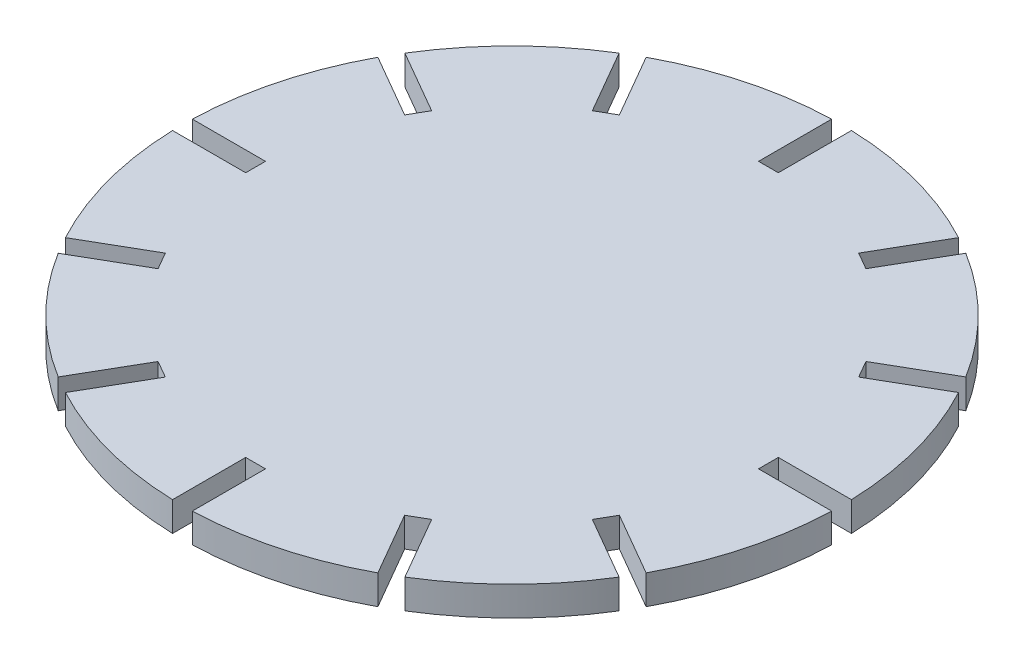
ISO-10303-21;
HEADER;
FILE_DESCRIPTION(('STEP AP214'),'2;1');
FILE_NAME('part.step','',(''),(''),'','','');
FILE_SCHEMA(('AUTOMOTIVE_DESIGN { 1 0 10303 214 1 1 1 1 }'));
ENDSEC;
DATA;
#1=APPLICATION_CONTEXT('core data for automotive mechanical design processes');
#2=APPLICATION_PROTOCOL_DEFINITION('international standard','automotive_design',2000,#1);
#3=PRODUCT_CONTEXT('',#1,'mechanical');
#4=PRODUCT('Part','Part','',(#3));
#5=PRODUCT_RELATED_PRODUCT_CATEGORY('part','',(#4));
#6=PRODUCT_DEFINITION_FORMATION('','',#4);
#7=PRODUCT_DEFINITION_CONTEXT('part definition',#1,'design');
#8=PRODUCT_DEFINITION('design','',#6,#7);
#9=PRODUCT_DEFINITION_SHAPE('','',#8);
#10=(LENGTH_UNIT() NAMED_UNIT(*) SI_UNIT(.MILLI.,.METRE.));
#11=(NAMED_UNIT(*) PLANE_ANGLE_UNIT() SI_UNIT($,.RADIAN.));
#12=(NAMED_UNIT(*) SI_UNIT($,.STERADIAN.) SOLID_ANGLE_UNIT());
#13=UNCERTAINTY_MEASURE_WITH_UNIT(LENGTH_MEASURE(1.E-05),#10,'distance_accuracy_value','');
#14=(GEOMETRIC_REPRESENTATION_CONTEXT(3) GLOBAL_UNCERTAINTY_ASSIGNED_CONTEXT((#13)) GLOBAL_UNIT_ASSIGNED_CONTEXT((#10,
#11,#12)) REPRESENTATION_CONTEXT('',''));
#15=CARTESIAN_POINT('',(0.,0.,0.));
#16=DIRECTION('',(0.,0.,1.));
#17=DIRECTION('',(1.,0.,0.));
#18=AXIS2_PLACEMENT_3D('',#15,#16,#17);
#19=CARTESIAN_POINT('',(0.,4.,0.));
#20=DIRECTION('',(0.,-1.,0.));
#21=DIRECTION('',(0.,0.,-1.));
#22=AXIS2_PLACEMENT_3D('',#19,#20,#21);
#23=CYLINDRICAL_SURFACE('',#22,45.);
#24=CARTESIAN_POINT('',(0.,0.,0.));
#25=DIRECTION('',(0.,1.,0.));
#26=DIRECTION('',(0.,0.,1.));
#27=AXIS2_PLACEMENT_3D('',#24,#25,#26);
#28=CIRCLE('',#27,45.);
#29=CARTESIAN_POINT('',(44.9797454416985,0.,-1.35));
#30=VERTEX_POINT('',#29);
#31=CARTESIAN_POINT('',(39.6286022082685,0.,-21.3207384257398));
#32=VERTEX_POINT('',#31);
#33=EDGE_CURVE('E802',#30,#32,#28,.T.);
#34=ORIENTED_EDGE('',*,*,#33,.T.);
#35=DIRECTION('',(0.,-1.,0.));
#36=VECTOR('',#35,1.);
#37=CARTESIAN_POINT('',(39.6286022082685,4.,-21.3207384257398));
#38=LINE('',#37,#36);
#39=CARTESIAN_POINT('',(39.6286022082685,4.,-21.3207384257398));
#40=VERTEX_POINT('',#39);
#41=EDGE_CURVE('E12',#40,#32,#38,.T.);
#42=ORIENTED_EDGE('',*,*,#41,.F.);
#43=CARTESIAN_POINT('',(0.,4.,0.));
#44=DIRECTION('',(0.,1.,0.));
#45=DIRECTION('',(0.,0.,1.));
#46=AXIS2_PLACEMENT_3D('',#43,#44,#45);
#47=CIRCLE('',#46,45.);
#48=CARTESIAN_POINT('',(44.9797454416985,4.,-1.35));
#49=VERTEX_POINT('',#48);
#50=EDGE_CURVE('E596',#49,#40,#47,.T.);
#51=ORIENTED_EDGE('',*,*,#50,.F.);
#52=DIRECTION('',(0.,-1.,0.));
#53=VECTOR('',#52,1.);
#54=CARTESIAN_POINT('',(44.9797454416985,4.,-1.35));
#55=LINE('',#54,#53);
#56=EDGE_CURVE('E381',#49,#30,#55,.T.);
#57=ORIENTED_EDGE('',*,*,#56,.T.);
#58=EDGE_LOOP('',(#34,#42,#51,#57));
#59=FACE_BOUND('',#58,.T.);
#60=ADVANCED_FACE('F44',(#59),#23,.T.);
#61=CARTESIAN_POINT('',(30.9856686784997,4.,-16.3307384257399));
#62=DIRECTION('',(0.499999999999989,0.,0.866025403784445));
#63=DIRECTION('',(0.866025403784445,0.,-0.499999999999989));
#64=AXIS2_PLACEMENT_3D('',#61,#62,#63);
#65=PLANE('',#64);
#66=DIRECTION('',(-0.866025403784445,0.,0.499999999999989));
#67=VECTOR('',#66,1.);
#68=CARTESIAN_POINT('',(30.9856686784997,0.,-16.3307384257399));
#69=LINE('',#68,#67);
#70=CARTESIAN_POINT('',(30.9856686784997,0.,-16.3307384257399));
#71=VERTEX_POINT('',#70);
#72=EDGE_CURVE('E793',#32,#71,#69,.T.);
#73=ORIENTED_EDGE('',*,*,#72,.T.);
#74=DIRECTION('',(0.,-1.,0.));
#75=VECTOR('',#74,1.);
#76=CARTESIAN_POINT('',(30.9856686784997,4.,-16.3307384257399));
#77=LINE('',#76,#75);
#78=CARTESIAN_POINT('',(30.9856686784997,4.,-16.3307384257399));
#79=VERTEX_POINT('',#78);
#80=EDGE_CURVE('E53',#79,#71,#77,.T.);
#81=ORIENTED_EDGE('',*,*,#80,.F.);
#82=DIRECTION('',(-0.866025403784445,0.,0.499999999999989));
#83=VECTOR('',#82,1.);
#84=CARTESIAN_POINT('',(30.9856686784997,4.,-16.3307384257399));
#85=LINE('',#84,#83);
#86=EDGE_CURVE('E224',#40,#79,#85,.T.);
#87=ORIENTED_EDGE('',*,*,#86,.F.);
#88=ORIENTED_EDGE('',*,*,#41,.T.);
#89=EDGE_LOOP('',(#73,#81,#87,#88));
#90=FACE_BOUND('',#89,.T.);
#91=ADVANCED_FACE('F946',(#90),#65,.F.);
#92=CARTESIAN_POINT('',(30.9856686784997,4.,-16.3307384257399));
#93=DIRECTION('',(-0.866025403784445,0.,0.499999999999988));
#94=DIRECTION('',(0.499999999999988,0.,0.866025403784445));
#95=AXIS2_PLACEMENT_3D('',#92,#93,#94);
#96=PLANE('',#95);
#97=DIRECTION('',(-0.499999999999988,0.,-0.866025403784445));
#98=VECTOR('',#97,1.);
#99=CARTESIAN_POINT('',(30.9856686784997,0.,-16.3307384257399));
#100=LINE('',#99,#98);
#101=CARTESIAN_POINT('',(29.6356686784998,0.,-18.6690070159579));
#102=VERTEX_POINT('',#101);
#103=EDGE_CURVE('E788',#71,#102,#100,.T.);
#104=ORIENTED_EDGE('',*,*,#103,.T.);
#105=DIRECTION('',(0.,-1.,0.));
#106=VECTOR('',#105,1.);
#107=CARTESIAN_POINT('',(29.6356686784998,4.,-18.6690070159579));
#108=LINE('',#107,#106);
#109=CARTESIAN_POINT('',(29.6356686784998,4.,-18.6690070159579));
#110=VERTEX_POINT('',#109);
#111=EDGE_CURVE('E778',#110,#102,#108,.T.);
#112=ORIENTED_EDGE('',*,*,#111,.F.);
#113=DIRECTION('',(-0.499999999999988,0.,-0.866025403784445));
#114=VECTOR('',#113,1.);
#115=CARTESIAN_POINT('',(30.9856686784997,4.,-16.3307384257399));
#116=LINE('',#115,#114);
#117=EDGE_CURVE('E588',#79,#110,#116,.T.);
#118=ORIENTED_EDGE('',*,*,#117,.F.);
#119=ORIENTED_EDGE('',*,*,#80,.T.);
#120=EDGE_LOOP('',(#104,#112,#118,#119));
#121=FACE_BOUND('',#120,.T.);
#122=ADVANCED_FACE('F786',(#121),#96,.F.);
#123=CARTESIAN_POINT('',(29.6356686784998,4.,-18.6690070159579));
#124=DIRECTION('',(-0.499999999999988,0.,-0.866025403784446));
#125=DIRECTION('',(-0.866025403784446,0.,0.499999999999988));
#126=AXIS2_PLACEMENT_3D('',#123,#124,#125);
#127=PLANE('',#126);
#128=DIRECTION('',(0.866025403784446,0.,-0.499999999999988));
#129=VECTOR('',#128,1.);
#130=CARTESIAN_POINT('',(29.6356686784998,0.,-18.6690070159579));
#131=LINE('',#130,#129);
#132=CARTESIAN_POINT('',(38.2786022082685,0.,-23.6590070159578));
#133=VERTEX_POINT('',#132);
#134=EDGE_CURVE('E795',#102,#133,#131,.T.);
#135=ORIENTED_EDGE('',*,*,#134,.T.);
#136=DIRECTION('',(0.,-1.,0.));
#137=VECTOR('',#136,1.);
#138=CARTESIAN_POINT('',(38.2786022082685,4.,-23.6590070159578));
#139=LINE('',#138,#137);
#140=CARTESIAN_POINT('',(38.2786022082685,4.,-23.6590070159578));
#141=VERTEX_POINT('',#140);
#142=EDGE_CURVE('E774',#141,#133,#139,.T.);
#143=ORIENTED_EDGE('',*,*,#142,.F.);
#144=DIRECTION('',(0.866025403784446,0.,-0.499999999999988));
#145=VECTOR('',#144,1.);
#146=CARTESIAN_POINT('',(29.6356686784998,4.,-18.6690070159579));
#147=LINE('',#146,#145);
#148=EDGE_CURVE('E584',#110,#141,#147,.T.);
#149=ORIENTED_EDGE('',*,*,#148,.F.);
#150=ORIENTED_EDGE('',*,*,#111,.T.);
#151=EDGE_LOOP('',(#135,#143,#149,#150));
#152=FACE_BOUND('',#151,.T.);
#153=ADVANCED_FACE('F953',(#152),#127,.F.);
#154=CARTESIAN_POINT('',(0.,4.,0.));
#155=DIRECTION('',(0.,-1.,0.));
#156=DIRECTION('',(0.,0.,-1.));
#157=AXIS2_PLACEMENT_3D('',#154,#155,#156);
#158=CYLINDRICAL_SURFACE('',#157,45.);
#159=CARTESIAN_POINT('',(0.,0.,0.));
#160=DIRECTION('',(0.,1.,0.));
#161=DIRECTION('',(0.,0.,1.));
#162=AXIS2_PLACEMENT_3D('',#159,#160,#161);
#163=CIRCLE('',#162,45.);
#164=CARTESIAN_POINT('',(23.6590070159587,0.,-38.278602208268));
#165=VERTEX_POINT('',#164);
#166=EDGE_CURVE('E800',#133,#165,#163,.T.);
#167=ORIENTED_EDGE('',*,*,#166,.T.);
#168=DIRECTION('',(0.,-1.,0.));
#169=VECTOR('',#168,1.);
#170=CARTESIAN_POINT('',(23.6590070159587,4.,-38.278602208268));
#171=LINE('',#170,#169);
#172=CARTESIAN_POINT('',(23.6590070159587,4.,-38.278602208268));
#173=VERTEX_POINT('',#172);
#174=EDGE_CURVE('E770',#173,#165,#171,.T.);
#175=ORIENTED_EDGE('',*,*,#174,.F.);
#176=CARTESIAN_POINT('',(0.,4.,0.));
#177=DIRECTION('',(0.,1.,0.));
#178=DIRECTION('',(0.,0.,1.));
#179=AXIS2_PLACEMENT_3D('',#176,#177,#178);
#180=CIRCLE('',#179,45.);
#181=EDGE_CURVE('E581',#141,#173,#180,.T.);
#182=ORIENTED_EDGE('',*,*,#181,.F.);
#183=ORIENTED_EDGE('',*,*,#142,.T.);
#184=EDGE_LOOP('',(#167,#175,#182,#183));
#185=FACE_BOUND('',#184,.T.);
#186=ADVANCED_FACE('F958',(#185),#158,.T.);
#187=CARTESIAN_POINT('',(18.6690070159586,4.,-29.6356686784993));
#188=DIRECTION('',(0.866025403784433,0.,0.50000000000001));
#189=DIRECTION('',(0.50000000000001,0.,-0.866025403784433));
#190=AXIS2_PLACEMENT_3D('',#187,#188,#189);
#191=PLANE('',#190);
#192=DIRECTION('',(-0.50000000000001,0.,0.866025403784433));
#193=VECTOR('',#192,1.);
#194=CARTESIAN_POINT('',(18.6690070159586,0.,-29.6356686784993));
#195=LINE('',#194,#193);
#196=CARTESIAN_POINT('',(18.6690070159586,0.,-29.6356686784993));
#197=VERTEX_POINT('',#196);
#198=EDGE_CURVE('E807',#165,#197,#195,.T.);
#199=ORIENTED_EDGE('',*,*,#198,.T.);
#200=DIRECTION('',(0.,-1.,0.));
#201=VECTOR('',#200,1.);
#202=CARTESIAN_POINT('',(18.6690070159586,4.,-29.6356686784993));
#203=LINE('',#202,#201);
#204=CARTESIAN_POINT('',(18.6690070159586,4.,-29.6356686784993));
#205=VERTEX_POINT('',#204);
#206=EDGE_CURVE('E766',#205,#197,#203,.T.);
#207=ORIENTED_EDGE('',*,*,#206,.F.);
#208=DIRECTION('',(-0.50000000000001,0.,0.866025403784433));
#209=VECTOR('',#208,1.);
#210=CARTESIAN_POINT('',(18.6690070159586,4.,-29.6356686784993));
#211=LINE('',#210,#209);
#212=EDGE_CURVE('E573',#173,#205,#211,.T.);
#213=ORIENTED_EDGE('',*,*,#212,.F.);
#214=ORIENTED_EDGE('',*,*,#174,.T.);
#215=EDGE_LOOP('',(#199,#207,#213,#214));
#216=FACE_BOUND('',#215,.T.);
#217=ADVANCED_FACE('F962',(#216),#191,.F.);
#218=CARTESIAN_POINT('',(18.6690070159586,4.,-29.6356686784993));
#219=DIRECTION('',(-0.500000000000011,0.,0.866025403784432));
#220=DIRECTION('',(0.866025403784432,0.,0.500000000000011));
#221=AXIS2_PLACEMENT_3D('',#218,#219,#220);
#222=PLANE('',#221);
#223=DIRECTION('',(-0.866025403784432,0.,-0.500000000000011));
#224=VECTOR('',#223,1.);
#225=CARTESIAN_POINT('',(18.6690070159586,0.,-29.6356686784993));
#226=LINE('',#225,#224);
#227=CARTESIAN_POINT('',(16.3307384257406,0.,-30.9856686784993));
#228=VERTEX_POINT('',#227);
#229=EDGE_CURVE('E810',#197,#228,#226,.T.);
#230=ORIENTED_EDGE('',*,*,#229,.T.);
#231=DIRECTION('',(0.,-1.,0.));
#232=VECTOR('',#231,1.);
#233=CARTESIAN_POINT('',(16.3307384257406,4.,-30.9856686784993));
#234=LINE('',#233,#232);
#235=CARTESIAN_POINT('',(16.3307384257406,4.,-30.9856686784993));
#236=VERTEX_POINT('',#235);
#237=EDGE_CURVE('E762',#236,#228,#234,.T.);
#238=ORIENTED_EDGE('',*,*,#237,.F.);
#239=DIRECTION('',(-0.866025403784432,0.,-0.500000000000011));
#240=VECTOR('',#239,1.);
#241=CARTESIAN_POINT('',(18.6690070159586,4.,-29.6356686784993));
#242=LINE('',#241,#240);
#243=EDGE_CURVE('E569',#205,#236,#242,.T.);
#244=ORIENTED_EDGE('',*,*,#243,.F.);
#245=ORIENTED_EDGE('',*,*,#206,.T.);
#246=EDGE_LOOP('',(#230,#238,#244,#245));
#247=FACE_BOUND('',#246,.T.);
#248=ADVANCED_FACE('F966',(#247),#222,.F.);
#249=CARTESIAN_POINT('',(16.3307384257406,4.,-30.9856686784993));
#250=DIRECTION('',(-0.866025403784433,0.,-0.50000000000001));
#251=DIRECTION('',(-0.50000000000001,0.,0.866025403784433));
#252=AXIS2_PLACEMENT_3D('',#249,#250,#251);
#253=PLANE('',#252);
#254=DIRECTION('',(0.50000000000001,0.,-0.866025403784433));
#255=VECTOR('',#254,1.);
#256=CARTESIAN_POINT('',(16.3307384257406,0.,-30.9856686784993));
#257=LINE('',#256,#255);
#258=CARTESIAN_POINT('',(21.3207384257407,0.,-39.628602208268));
#259=VERTEX_POINT('',#258);
#260=EDGE_CURVE('E813',#228,#259,#257,.T.);
#261=ORIENTED_EDGE('',*,*,#260,.T.);
#262=DIRECTION('',(0.,-1.,0.));
#263=VECTOR('',#262,1.);
#264=CARTESIAN_POINT('',(21.3207384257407,4.,-39.628602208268));
#265=LINE('',#264,#263);
#266=CARTESIAN_POINT('',(21.3207384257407,4.,-39.628602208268));
#267=VERTEX_POINT('',#266);
#268=EDGE_CURVE('E758',#267,#259,#265,.T.);
#269=ORIENTED_EDGE('',*,*,#268,.F.);
#270=DIRECTION('',(0.50000000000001,0.,-0.866025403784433));
#271=VECTOR('',#270,1.);
#272=CARTESIAN_POINT('',(16.3307384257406,4.,-30.9856686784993));
#273=LINE('',#272,#271);
#274=EDGE_CURVE('E565',#236,#267,#273,.T.);
#275=ORIENTED_EDGE('',*,*,#274,.F.);
#276=ORIENTED_EDGE('',*,*,#237,.T.);
#277=EDGE_LOOP('',(#261,#269,#275,#276));
#278=FACE_BOUND('',#277,.T.);
#279=ADVANCED_FACE('F970',(#278),#253,.F.);
#280=CARTESIAN_POINT('',(0.,4.,0.));
#281=DIRECTION('',(0.,-1.,0.));
#282=DIRECTION('',(0.,0.,-1.));
#283=AXIS2_PLACEMENT_3D('',#280,#281,#282);
#284=CYLINDRICAL_SURFACE('',#283,45.);
#285=CARTESIAN_POINT('',(0.,0.,0.));
#286=DIRECTION('',(0.,1.,0.));
#287=DIRECTION('',(0.,0.,1.));
#288=AXIS2_PLACEMENT_3D('',#285,#286,#287);
#289=CIRCLE('',#288,45.);
#290=CARTESIAN_POINT('',(1.35000000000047,0.,-44.9797454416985));
#291=VERTEX_POINT('',#290);
#292=EDGE_CURVE('E816',#259,#291,#289,.T.);
#293=ORIENTED_EDGE('',*,*,#292,.T.);
#294=DIRECTION('',(0.,-1.,0.));
#295=VECTOR('',#294,1.);
#296=CARTESIAN_POINT('',(1.35000000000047,4.,-44.9797454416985));
#297=LINE('',#296,#295);
#298=CARTESIAN_POINT('',(1.35000000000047,4.,-44.9797454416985));
#299=VERTEX_POINT('',#298);
#300=EDGE_CURVE('E754',#299,#291,#297,.T.);
#301=ORIENTED_EDGE('',*,*,#300,.F.);
#302=CARTESIAN_POINT('',(0.,4.,0.));
#303=DIRECTION('',(0.,1.,0.));
#304=DIRECTION('',(0.,0.,1.));
#305=AXIS2_PLACEMENT_3D('',#302,#303,#304);
#306=CIRCLE('',#305,45.);
#307=EDGE_CURVE('E562',#267,#299,#306,.T.);
#308=ORIENTED_EDGE('',*,*,#307,.F.);
#309=ORIENTED_EDGE('',*,*,#268,.T.);
#310=EDGE_LOOP('',(#293,#301,#308,#309));
#311=FACE_BOUND('',#310,.T.);
#312=ADVANCED_FACE('F974',(#311),#284,.T.);
#313=CARTESIAN_POINT('',(1.35000000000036,4.,-34.9997454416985));
#314=DIRECTION('',(1.,0.,0.));
#315=DIRECTION('',(0.,0.,-1.));
#316=AXIS2_PLACEMENT_3D('',#313,#314,#315);
#317=PLANE('',#316);
#318=DIRECTION('',(0.,0.,1.));
#319=VECTOR('',#318,1.);
#320=CARTESIAN_POINT('',(1.35000000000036,0.,-34.9997454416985));
#321=LINE('',#320,#319);
#322=CARTESIAN_POINT('',(1.35000000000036,0.,-34.9997454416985));
#323=VERTEX_POINT('',#322);
#324=EDGE_CURVE('E819',#291,#323,#321,.T.);
#325=ORIENTED_EDGE('',*,*,#324,.T.);
#326=DIRECTION('',(0.,-1.,0.));
#327=VECTOR('',#326,1.);
#328=CARTESIAN_POINT('',(1.35000000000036,4.,-34.9997454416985));
#329=LINE('',#328,#327);
#330=CARTESIAN_POINT('',(1.35000000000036,4.,-34.9997454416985));
#331=VERTEX_POINT('',#330);
#332=EDGE_CURVE('E750',#331,#323,#329,.T.);
#333=ORIENTED_EDGE('',*,*,#332,.F.);
#334=DIRECTION('',(0.,0.,1.));
#335=VECTOR('',#334,1.);
#336=CARTESIAN_POINT('',(1.35000000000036,4.,-34.9997454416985));
#337=LINE('',#336,#335);
#338=EDGE_CURVE('E554',#299,#331,#337,.T.);
#339=ORIENTED_EDGE('',*,*,#338,.F.);
#340=ORIENTED_EDGE('',*,*,#300,.T.);
#341=EDGE_LOOP('',(#325,#333,#339,#340));
#342=FACE_BOUND('',#341,.T.);
#343=ADVANCED_FACE('F978',(#342),#317,.F.);
#344=CARTESIAN_POINT('',(1.35000000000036,4.,-34.9997454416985));
#345=DIRECTION('',(0.,0.,1.));
#346=DIRECTION('',(1.,0.,0.));
#347=AXIS2_PLACEMENT_3D('',#344,#345,#346);
#348=PLANE('',#347);
#349=DIRECTION('',(-1.,0.,0.));
#350=VECTOR('',#349,1.);
#351=CARTESIAN_POINT('',(1.35000000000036,0.,-34.9997454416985));
#352=LINE('',#351,#350);
#353=CARTESIAN_POINT('',(-1.34999999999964,0.,-34.9997454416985));
#354=VERTEX_POINT('',#353);
#355=EDGE_CURVE('E822',#323,#354,#352,.T.);
#356=ORIENTED_EDGE('',*,*,#355,.T.);
#357=DIRECTION('',(0.,-1.,0.));
#358=VECTOR('',#357,1.);
#359=CARTESIAN_POINT('',(-1.34999999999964,4.,-34.9997454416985));
#360=LINE('',#359,#358);
#361=CARTESIAN_POINT('',(-1.34999999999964,4.,-34.9997454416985));
#362=VERTEX_POINT('',#361);
#363=EDGE_CURVE('E746',#362,#354,#360,.T.);
#364=ORIENTED_EDGE('',*,*,#363,.F.);
#365=DIRECTION('',(-1.,0.,0.));
#366=VECTOR('',#365,1.);
#367=CARTESIAN_POINT('',(1.35000000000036,4.,-34.9997454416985));
#368=LINE('',#367,#366);
#369=EDGE_CURVE('E550',#331,#362,#368,.T.);
#370=ORIENTED_EDGE('',*,*,#369,.F.);
#371=ORIENTED_EDGE('',*,*,#332,.T.);
#372=EDGE_LOOP('',(#356,#364,#370,#371));
#373=FACE_BOUND('',#372,.T.);
#374=ADVANCED_FACE('F982',(#373),#348,.F.);
#375=CARTESIAN_POINT('',(-1.34999999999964,4.,-34.9997454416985));
#376=DIRECTION('',(-1.,0.,0.));
#377=DIRECTION('',(0.,0.,1.));
#378=AXIS2_PLACEMENT_3D('',#375,#376,#377);
#379=PLANE('',#378);
#380=DIRECTION('',(0.,0.,-1.));
#381=VECTOR('',#380,1.);
#382=CARTESIAN_POINT('',(-1.34999999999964,0.,-34.9997454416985));
#383=LINE('',#382,#381);
#384=CARTESIAN_POINT('',(-1.34999999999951,0.,-44.9797454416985));
#385=VERTEX_POINT('',#384);
#386=EDGE_CURVE('E825',#354,#385,#383,.T.);
#387=ORIENTED_EDGE('',*,*,#386,.T.);
#388=DIRECTION('',(0.,-1.,0.));
#389=VECTOR('',#388,1.);
#390=CARTESIAN_POINT('',(-1.34999999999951,4.,-44.9797454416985));
#391=LINE('',#390,#389);
#392=CARTESIAN_POINT('',(-1.34999999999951,4.,-44.9797454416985));
#393=VERTEX_POINT('',#392);
#394=EDGE_CURVE('E742',#393,#385,#391,.T.);
#395=ORIENTED_EDGE('',*,*,#394,.F.);
#396=DIRECTION('',(0.,0.,-1.));
#397=VECTOR('',#396,1.);
#398=CARTESIAN_POINT('',(-1.34999999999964,4.,-34.9997454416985));
#399=LINE('',#398,#397);
#400=EDGE_CURVE('E546',#362,#393,#399,.T.);
#401=ORIENTED_EDGE('',*,*,#400,.F.);
#402=ORIENTED_EDGE('',*,*,#363,.T.);
#403=EDGE_LOOP('',(#387,#395,#401,#402));
#404=FACE_BOUND('',#403,.T.);
#405=ADVANCED_FACE('F986',(#404),#379,.F.);
#406=CARTESIAN_POINT('',(0.,4.,0.));
#407=DIRECTION('',(0.,-1.,0.));
#408=DIRECTION('',(0.,0.,-1.));
#409=AXIS2_PLACEMENT_3D('',#406,#407,#408);
#410=CYLINDRICAL_SURFACE('',#409,45.);
#411=CARTESIAN_POINT('',(0.,0.,0.));
#412=DIRECTION('',(0.,1.,0.));
#413=DIRECTION('',(0.,0.,1.));
#414=AXIS2_PLACEMENT_3D('',#411,#412,#413);
#415=CIRCLE('',#414,45.);
#416=CARTESIAN_POINT('',(-21.3207384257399,0.,-39.6286022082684));
#417=VERTEX_POINT('',#416);
#418=EDGE_CURVE('E828',#385,#417,#415,.T.);
#419=ORIENTED_EDGE('',*,*,#418,.T.);
#420=DIRECTION('',(0.,-1.,0.));
#421=VECTOR('',#420,1.);
#422=CARTESIAN_POINT('',(-21.3207384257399,4.,-39.6286022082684));
#423=LINE('',#422,#421);
#424=CARTESIAN_POINT('',(-21.3207384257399,4.,-39.6286022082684));
#425=VERTEX_POINT('',#424);
#426=EDGE_CURVE('E738',#425,#417,#423,.T.);
#427=ORIENTED_EDGE('',*,*,#426,.F.);
#428=CARTESIAN_POINT('',(0.,4.,0.));
#429=DIRECTION('',(0.,1.,0.));
#430=DIRECTION('',(0.,0.,1.));
#431=AXIS2_PLACEMENT_3D('',#428,#429,#430);
#432=CIRCLE('',#431,45.);
#433=EDGE_CURVE('E543',#393,#425,#432,.T.);
#434=ORIENTED_EDGE('',*,*,#433,.F.);
#435=ORIENTED_EDGE('',*,*,#394,.T.);
#436=EDGE_LOOP('',(#419,#427,#434,#435));
#437=FACE_BOUND('',#436,.T.);
#438=ADVANCED_FACE('F990',(#437),#410,.T.);
#439=CARTESIAN_POINT('',(-16.33073842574,4.,-30.9856686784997));
#440=DIRECTION('',(0.866025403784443,0.,-0.499999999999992));
#441=DIRECTION('',(-0.499999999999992,0.,-0.866025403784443));
#442=AXIS2_PLACEMENT_3D('',#439,#440,#441);
#443=PLANE('',#442);
#444=DIRECTION('',(0.499999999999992,0.,0.866025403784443));
#445=VECTOR('',#444,1.);
#446=CARTESIAN_POINT('',(-16.33073842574,0.,-30.9856686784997));
#447=LINE('',#446,#445);
#448=CARTESIAN_POINT('',(-16.33073842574,0.,-30.9856686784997));
#449=VERTEX_POINT('',#448);
#450=EDGE_CURVE('E831',#417,#449,#447,.T.);
#451=ORIENTED_EDGE('',*,*,#450,.T.);
#452=DIRECTION('',(0.,-1.,0.));
#453=VECTOR('',#452,1.);
#454=CARTESIAN_POINT('',(-16.33073842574,4.,-30.9856686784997));
#455=LINE('',#454,#453);
#456=CARTESIAN_POINT('',(-16.33073842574,4.,-30.9856686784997));
#457=VERTEX_POINT('',#456);
#458=EDGE_CURVE('E734',#457,#449,#455,.T.);
#459=ORIENTED_EDGE('',*,*,#458,.F.);
#460=DIRECTION('',(0.499999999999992,0.,0.866025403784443));
#461=VECTOR('',#460,1.);
#462=CARTESIAN_POINT('',(-16.33073842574,4.,-30.9856686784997));
#463=LINE('',#462,#461);
#464=EDGE_CURVE('E535',#425,#457,#463,.T.);
#465=ORIENTED_EDGE('',*,*,#464,.F.);
#466=ORIENTED_EDGE('',*,*,#426,.T.);
#467=EDGE_LOOP('',(#451,#459,#465,#466));
#468=FACE_BOUND('',#467,.T.);
#469=ADVANCED_FACE('F994',(#468),#443,.F.);
#470=CARTESIAN_POINT('',(-16.33073842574,4.,-30.9856686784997));
#471=DIRECTION('',(0.499999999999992,0.,0.866025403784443));
#472=DIRECTION('',(0.866025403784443,0.,-0.499999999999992));
#473=AXIS2_PLACEMENT_3D('',#470,#471,#472);
#474=PLANE('',#473);
#475=DIRECTION('',(-0.866025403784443,0.,0.499999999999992));
#476=VECTOR('',#475,1.);
#477=CARTESIAN_POINT('',(-16.33073842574,0.,-30.9856686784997));
#478=LINE('',#477,#476);
#479=CARTESIAN_POINT('',(-18.669007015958,0.,-29.6356686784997));
#480=VERTEX_POINT('',#479);
#481=EDGE_CURVE('E834',#449,#480,#478,.T.);
#482=ORIENTED_EDGE('',*,*,#481,.T.);
#483=DIRECTION('',(0.,-1.,0.));
#484=VECTOR('',#483,1.);
#485=CARTESIAN_POINT('',(-18.669007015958,4.,-29.6356686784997));
#486=LINE('',#485,#484);
#487=CARTESIAN_POINT('',(-18.669007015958,4.,-29.6356686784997));
#488=VERTEX_POINT('',#487);
#489=EDGE_CURVE('E730',#488,#480,#486,.T.);
#490=ORIENTED_EDGE('',*,*,#489,.F.);
#491=DIRECTION('',(-0.866025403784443,0.,0.499999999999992));
#492=VECTOR('',#491,1.);
#493=CARTESIAN_POINT('',(-16.33073842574,4.,-30.9856686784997));
#494=LINE('',#493,#492);
#495=EDGE_CURVE('E531',#457,#488,#494,.T.);
#496=ORIENTED_EDGE('',*,*,#495,.F.);
#497=ORIENTED_EDGE('',*,*,#458,.T.);
#498=EDGE_LOOP('',(#482,#490,#496,#497));
#499=FACE_BOUND('',#498,.T.);
#500=ADVANCED_FACE('F998',(#499),#474,.F.);
#501=CARTESIAN_POINT('',(-18.669007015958,4.,-29.6356686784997));
#502=DIRECTION('',(-0.866025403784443,0.,0.499999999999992));
#503=DIRECTION('',(0.499999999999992,0.,0.866025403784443));
#504=AXIS2_PLACEMENT_3D('',#501,#502,#503);
#505=PLANE('',#504);
#506=DIRECTION('',(-0.499999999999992,0.,-0.866025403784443));
#507=VECTOR('',#506,1.);
#508=CARTESIAN_POINT('',(-18.669007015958,0.,-29.6356686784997));
#509=LINE('',#508,#507);
#510=CARTESIAN_POINT('',(-23.6590070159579,0.,-38.2786022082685));
#511=VERTEX_POINT('',#510);
#512=EDGE_CURVE('E837',#480,#511,#509,.T.);
#513=ORIENTED_EDGE('',*,*,#512,.T.);
#514=DIRECTION('',(0.,-1.,0.));
#515=VECTOR('',#514,1.);
#516=CARTESIAN_POINT('',(-23.6590070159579,4.,-38.2786022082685));
#517=LINE('',#516,#515);
#518=CARTESIAN_POINT('',(-23.6590070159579,4.,-38.2786022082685));
#519=VERTEX_POINT('',#518);
#520=EDGE_CURVE('E726',#519,#511,#517,.T.);
#521=ORIENTED_EDGE('',*,*,#520,.F.);
#522=DIRECTION('',(-0.499999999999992,0.,-0.866025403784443));
#523=VECTOR('',#522,1.);
#524=CARTESIAN_POINT('',(-18.669007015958,4.,-29.6356686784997));
#525=LINE('',#524,#523);
#526=EDGE_CURVE('E527',#488,#519,#525,.T.);
#527=ORIENTED_EDGE('',*,*,#526,.F.);
#528=ORIENTED_EDGE('',*,*,#489,.T.);
#529=EDGE_LOOP('',(#513,#521,#527,#528));
#530=FACE_BOUND('',#529,.T.);
#531=ADVANCED_FACE('F1002',(#530),#505,.F.);
#532=CARTESIAN_POINT('',(0.,4.,0.));
#533=DIRECTION('',(0.,-1.,0.));
#534=DIRECTION('',(0.,0.,-1.));
#535=AXIS2_PLACEMENT_3D('',#532,#533,#534);
#536=CYLINDRICAL_SURFACE('',#535,45.);
#537=CARTESIAN_POINT('',(0.,0.,0.));
#538=DIRECTION('',(0.,1.,0.));
#539=DIRECTION('',(0.,0.,1.));
#540=AXIS2_PLACEMENT_3D('',#537,#538,#539);
#541=CIRCLE('',#540,45.);
#542=CARTESIAN_POINT('',(-38.278602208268,0.,-23.6590070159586));
#543=VERTEX_POINT('',#542);
#544=EDGE_CURVE('E840',#511,#543,#541,.T.);
#545=ORIENTED_EDGE('',*,*,#544,.T.);
#546=DIRECTION('',(0.,-1.,0.));
#547=VECTOR('',#546,1.);
#548=CARTESIAN_POINT('',(-38.278602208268,4.,-23.6590070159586));
#549=LINE('',#548,#547);
#550=CARTESIAN_POINT('',(-38.278602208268,4.,-23.6590070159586));
#551=VERTEX_POINT('',#550);
#552=EDGE_CURVE('E722',#551,#543,#549,.T.);
#553=ORIENTED_EDGE('',*,*,#552,.F.);
#554=CARTESIAN_POINT('',(0.,4.,0.));
#555=DIRECTION('',(0.,1.,0.));
#556=DIRECTION('',(0.,0.,1.));
#557=AXIS2_PLACEMENT_3D('',#554,#555,#556);
#558=CIRCLE('',#557,45.);
#559=EDGE_CURVE('E524',#519,#551,#558,.T.);
#560=ORIENTED_EDGE('',*,*,#559,.F.);
#561=ORIENTED_EDGE('',*,*,#520,.T.);
#562=EDGE_LOOP('',(#545,#553,#560,#561));
#563=FACE_BOUND('',#562,.T.);
#564=ADVANCED_FACE('F1006',(#563),#536,.T.);
#565=CARTESIAN_POINT('',(-29.6356686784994,4.,-18.6690070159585));
#566=DIRECTION('',(0.500000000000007,0.,-0.866025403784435));
#567=DIRECTION('',(-0.866025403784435,0.,-0.500000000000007));
#568=AXIS2_PLACEMENT_3D('',#565,#566,#567);
#569=PLANE('',#568);
#570=DIRECTION('',(0.866025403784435,0.,0.500000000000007));
#571=VECTOR('',#570,1.);
#572=CARTESIAN_POINT('',(-29.6356686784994,0.,-18.6690070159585));
#573=LINE('',#572,#571);
#574=CARTESIAN_POINT('',(-29.6356686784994,0.,-18.6690070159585));
#575=VERTEX_POINT('',#574);
#576=EDGE_CURVE('E843',#543,#575,#573,.T.);
#577=ORIENTED_EDGE('',*,*,#576,.T.);
#578=DIRECTION('',(0.,-1.,0.));
#579=VECTOR('',#578,1.);
#580=CARTESIAN_POINT('',(-29.6356686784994,4.,-18.6690070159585));
#581=LINE('',#580,#579);
#582=CARTESIAN_POINT('',(-29.6356686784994,4.,-18.6690070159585));
#583=VERTEX_POINT('',#582);
#584=EDGE_CURVE('E718',#583,#575,#581,.T.);
#585=ORIENTED_EDGE('',*,*,#584,.F.);
#586=DIRECTION('',(0.866025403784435,0.,0.500000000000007));
#587=VECTOR('',#586,1.);
#588=CARTESIAN_POINT('',(-29.6356686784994,4.,-18.6690070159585));
#589=LINE('',#588,#587);
#590=EDGE_CURVE('E516',#551,#583,#589,.T.);
#591=ORIENTED_EDGE('',*,*,#590,.F.);
#592=ORIENTED_EDGE('',*,*,#552,.T.);
#593=EDGE_LOOP('',(#577,#585,#591,#592));
#594=FACE_BOUND('',#593,.T.);
#595=ADVANCED_FACE('F1010',(#594),#569,.F.);
#596=CARTESIAN_POINT('',(-29.6356686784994,4.,-18.6690070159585));
#597=DIRECTION('',(0.866025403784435,0.,0.500000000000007));
#598=DIRECTION('',(0.500000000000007,0.,-0.866025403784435));
#599=AXIS2_PLACEMENT_3D('',#596,#597,#598);
#600=PLANE('',#599);
#601=DIRECTION('',(-0.500000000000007,0.,0.866025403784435));
#602=VECTOR('',#601,1.);
#603=CARTESIAN_POINT('',(-29.6356686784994,0.,-18.6690070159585));
#604=LINE('',#603,#602);
#605=CARTESIAN_POINT('',(-30.9856686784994,0.,-16.3307384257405));
#606=VERTEX_POINT('',#605);
#607=EDGE_CURVE('E846',#575,#606,#604,.T.);
#608=ORIENTED_EDGE('',*,*,#607,.T.);
#609=DIRECTION('',(0.,-1.,0.));
#610=VECTOR('',#609,1.);
#611=CARTESIAN_POINT('',(-30.9856686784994,4.,-16.3307384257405));
#612=LINE('',#611,#610);
#613=CARTESIAN_POINT('',(-30.9856686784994,4.,-16.3307384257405));
#614=VERTEX_POINT('',#613);
#615=EDGE_CURVE('E714',#614,#606,#612,.T.);
#616=ORIENTED_EDGE('',*,*,#615,.F.);
#617=DIRECTION('',(-0.500000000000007,0.,0.866025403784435));
#618=VECTOR('',#617,1.);
#619=CARTESIAN_POINT('',(-29.6356686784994,4.,-18.6690070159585));
#620=LINE('',#619,#618);
#621=EDGE_CURVE('E512',#583,#614,#620,.T.);
#622=ORIENTED_EDGE('',*,*,#621,.F.);
#623=ORIENTED_EDGE('',*,*,#584,.T.);
#624=EDGE_LOOP('',(#608,#616,#622,#623));
#625=FACE_BOUND('',#624,.T.);
#626=ADVANCED_FACE('F1014',(#625),#600,.F.);
#627=CARTESIAN_POINT('',(-30.9856686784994,4.,-16.3307384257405));
#628=DIRECTION('',(-0.500000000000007,0.,0.866025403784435));
#629=DIRECTION('',(0.866025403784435,0.,0.500000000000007));
#630=AXIS2_PLACEMENT_3D('',#627,#628,#629);
#631=PLANE('',#630);
#632=DIRECTION('',(-0.866025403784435,0.,-0.500000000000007));
#633=VECTOR('',#632,1.);
#634=CARTESIAN_POINT('',(-30.9856686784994,0.,-16.3307384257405));
#635=LINE('',#634,#633);
#636=CARTESIAN_POINT('',(-39.6286022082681,0.,-21.3207384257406));
#637=VERTEX_POINT('',#636);
#638=EDGE_CURVE('E849',#606,#637,#635,.T.);
#639=ORIENTED_EDGE('',*,*,#638,.T.);
#640=DIRECTION('',(0.,-1.,0.));
#641=VECTOR('',#640,1.);
#642=CARTESIAN_POINT('',(-39.6286022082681,4.,-21.3207384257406));
#643=LINE('',#642,#641);
#644=CARTESIAN_POINT('',(-39.6286022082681,4.,-21.3207384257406));
#645=VERTEX_POINT('',#644);
#646=EDGE_CURVE('E710',#645,#637,#643,.T.);
#647=ORIENTED_EDGE('',*,*,#646,.F.);
#648=DIRECTION('',(-0.866025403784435,0.,-0.500000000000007));
#649=VECTOR('',#648,1.);
#650=CARTESIAN_POINT('',(-30.9856686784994,4.,-16.3307384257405));
#651=LINE('',#650,#649);
#652=EDGE_CURVE('E508',#614,#645,#651,.T.);
#653=ORIENTED_EDGE('',*,*,#652,.F.);
#654=ORIENTED_EDGE('',*,*,#615,.T.);
#655=EDGE_LOOP('',(#639,#647,#653,#654));
#656=FACE_BOUND('',#655,.T.);
#657=ADVANCED_FACE('F1018',(#656),#631,.F.);
#658=CARTESIAN_POINT('',(0.,4.,0.));
#659=DIRECTION('',(0.,-1.,0.));
#660=DIRECTION('',(0.,0.,-1.));
#661=AXIS2_PLACEMENT_3D('',#658,#659,#660);
#662=CYLINDRICAL_SURFACE('',#661,45.);
#663=CARTESIAN_POINT('',(0.,0.,0.));
#664=DIRECTION('',(0.,1.,0.));
#665=DIRECTION('',(0.,0.,1.));
#666=AXIS2_PLACEMENT_3D('',#663,#664,#665);
#667=CIRCLE('',#666,45.);
#668=CARTESIAN_POINT('',(-44.9797454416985,0.,-1.35000000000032));
#669=VERTEX_POINT('',#668);
#670=EDGE_CURVE('E852',#637,#669,#667,.T.);
#671=ORIENTED_EDGE('',*,*,#670,.T.);
#672=DIRECTION('',(0.,-1.,0.));
#673=VECTOR('',#672,1.);
#674=CARTESIAN_POINT('',(-44.9797454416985,4.,-1.35000000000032));
#675=LINE('',#674,#673);
#676=CARTESIAN_POINT('',(-44.9797454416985,4.,-1.35000000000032));
#677=VERTEX_POINT('',#676);
#678=EDGE_CURVE('E706',#677,#669,#675,.T.);
#679=ORIENTED_EDGE('',*,*,#678,.F.);
#680=CARTESIAN_POINT('',(0.,4.,0.));
#681=DIRECTION('',(0.,1.,0.));
#682=DIRECTION('',(0.,0.,1.));
#683=AXIS2_PLACEMENT_3D('',#680,#681,#682);
#684=CIRCLE('',#683,45.);
#685=EDGE_CURVE('E505',#645,#677,#684,.T.);
#686=ORIENTED_EDGE('',*,*,#685,.F.);
#687=ORIENTED_EDGE('',*,*,#646,.T.);
#688=EDGE_LOOP('',(#671,#679,#686,#687));
#689=FACE_BOUND('',#688,.T.);
#690=ADVANCED_FACE('F1022',(#689),#662,.T.);
#691=CARTESIAN_POINT('',(-34.9997454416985,4.,-1.35000000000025));
#692=DIRECTION('',(0.,0.,-1.));
#693=DIRECTION('',(-1.,0.,0.));
#694=AXIS2_PLACEMENT_3D('',#691,#692,#693);
#695=PLANE('',#694);
#696=DIRECTION('',(1.,0.,0.));
#697=VECTOR('',#696,1.);
#698=CARTESIAN_POINT('',(-34.9997454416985,0.,-1.35000000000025));
#699=LINE('',#698,#697);
#700=CARTESIAN_POINT('',(-34.9997454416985,0.,-1.35000000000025));
#701=VERTEX_POINT('',#700);
#702=EDGE_CURVE('E855',#669,#701,#699,.T.);
#703=ORIENTED_EDGE('',*,*,#702,.T.);
#704=DIRECTION('',(0.,-1.,0.));
#705=VECTOR('',#704,1.);
#706=CARTESIAN_POINT('',(-34.9997454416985,4.,-1.35000000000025));
#707=LINE('',#706,#705);
#708=CARTESIAN_POINT('',(-34.9997454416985,4.,-1.35000000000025));
#709=VERTEX_POINT('',#708);
#710=EDGE_CURVE('E702',#709,#701,#707,.T.);
#711=ORIENTED_EDGE('',*,*,#710,.F.);
#712=DIRECTION('',(1.,0.,0.));
#713=VECTOR('',#712,1.);
#714=CARTESIAN_POINT('',(-34.9997454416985,4.,-1.35000000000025));
#715=LINE('',#714,#713);
#716=EDGE_CURVE('E497',#677,#709,#715,.T.);
#717=ORIENTED_EDGE('',*,*,#716,.F.);
#718=ORIENTED_EDGE('',*,*,#678,.T.);
#719=EDGE_LOOP('',(#703,#711,#717,#718));
#720=FACE_BOUND('',#719,.T.);
#721=ADVANCED_FACE('F1026',(#720),#695,.F.);
#722=CARTESIAN_POINT('',(-34.9997454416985,4.,-1.35000000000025));
#723=DIRECTION('',(1.,0.,0.));
#724=DIRECTION('',(0.,0.,-1.));
#725=AXIS2_PLACEMENT_3D('',#722,#723,#724);
#726=PLANE('',#725);
#727=DIRECTION('',(0.,0.,1.));
#728=VECTOR('',#727,1.);
#729=CARTESIAN_POINT('',(-34.9997454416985,0.,-1.35000000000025));
#730=LINE('',#729,#728);
#731=CARTESIAN_POINT('',(-34.9997454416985,0.,1.34999999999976));
#732=VERTEX_POINT('',#731);
#733=EDGE_CURVE('E858',#701,#732,#730,.T.);
#734=ORIENTED_EDGE('',*,*,#733,.T.);
#735=DIRECTION('',(0.,-1.,0.));
#736=VECTOR('',#735,1.);
#737=CARTESIAN_POINT('',(-34.9997454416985,4.,1.34999999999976));
#738=LINE('',#737,#736);
#739=CARTESIAN_POINT('',(-34.9997454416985,4.,1.34999999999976));
#740=VERTEX_POINT('',#739);
#741=EDGE_CURVE('E698',#740,#732,#738,.T.);
#742=ORIENTED_EDGE('',*,*,#741,.F.);
#743=DIRECTION('',(0.,0.,1.));
#744=VECTOR('',#743,1.);
#745=CARTESIAN_POINT('',(-34.9997454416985,4.,-1.35000000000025));
#746=LINE('',#745,#744);
#747=EDGE_CURVE('E493',#709,#740,#746,.T.);
#748=ORIENTED_EDGE('',*,*,#747,.F.);
#749=ORIENTED_EDGE('',*,*,#710,.T.);
#750=EDGE_LOOP('',(#734,#742,#748,#749));
#751=FACE_BOUND('',#750,.T.);
#752=ADVANCED_FACE('F1030',(#751),#726,.F.);
#753=CARTESIAN_POINT('',(-34.9997454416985,4.,1.34999999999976));
#754=DIRECTION('',(0.,0.,1.));
#755=DIRECTION('',(1.,0.,0.));
#756=AXIS2_PLACEMENT_3D('',#753,#754,#755);
#757=PLANE('',#756);
#758=DIRECTION('',(-1.,0.,0.));
#759=VECTOR('',#758,1.);
#760=CARTESIAN_POINT('',(-34.9997454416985,0.,1.34999999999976));
#761=LINE('',#760,#759);
#762=CARTESIAN_POINT('',(-44.9797454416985,0.,1.34999999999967));
#763=VERTEX_POINT('',#762);
#764=EDGE_CURVE('E861',#732,#763,#761,.T.);
#765=ORIENTED_EDGE('',*,*,#764,.T.);
#766=DIRECTION('',(0.,-1.,0.));
#767=VECTOR('',#766,1.);
#768=CARTESIAN_POINT('',(-44.9797454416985,4.,1.34999999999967));
#769=LINE('',#768,#767);
#770=CARTESIAN_POINT('',(-44.9797454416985,4.,1.34999999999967));
#771=VERTEX_POINT('',#770);
#772=EDGE_CURVE('E694',#771,#763,#769,.T.);
#773=ORIENTED_EDGE('',*,*,#772,.F.);
#774=DIRECTION('',(-1.,0.,0.));
#775=VECTOR('',#774,1.);
#776=CARTESIAN_POINT('',(-34.9997454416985,4.,1.34999999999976));
#777=LINE('',#776,#775);
#778=EDGE_CURVE('E489',#740,#771,#777,.T.);
#779=ORIENTED_EDGE('',*,*,#778,.F.);
#780=ORIENTED_EDGE('',*,*,#741,.T.);
#781=EDGE_LOOP('',(#765,#773,#779,#780));
#782=FACE_BOUND('',#781,.T.);
#783=ADVANCED_FACE('F1034',(#782),#757,.F.);
#784=CARTESIAN_POINT('',(0.,4.,0.));
#785=DIRECTION('',(0.,-1.,0.));
#786=DIRECTION('',(0.,0.,-1.));
#787=AXIS2_PLACEMENT_3D('',#784,#785,#786);
#788=CYLINDRICAL_SURFACE('',#787,45.);
#789=CARTESIAN_POINT('',(0.,0.,0.));
#790=DIRECTION('',(0.,1.,0.));
#791=DIRECTION('',(0.,0.,1.));
#792=AXIS2_PLACEMENT_3D('',#789,#790,#791);
#793=CIRCLE('',#792,45.);
#794=CARTESIAN_POINT('',(-39.6286022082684,0.,21.32073842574));
#795=VERTEX_POINT('',#794);
#796=EDGE_CURVE('E864',#763,#795,#793,.T.);
#797=ORIENTED_EDGE('',*,*,#796,.T.);
#798=DIRECTION('',(0.,-1.,0.));
#799=VECTOR('',#798,1.);
#800=CARTESIAN_POINT('',(-39.6286022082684,4.,21.32073842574));
#801=LINE('',#800,#799);
#802=CARTESIAN_POINT('',(-39.6286022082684,4.,21.32073842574));
#803=VERTEX_POINT('',#802);
#804=EDGE_CURVE('E690',#803,#795,#801,.T.);
#805=ORIENTED_EDGE('',*,*,#804,.F.);
#806=CARTESIAN_POINT('',(0.,4.,0.));
#807=DIRECTION('',(0.,1.,0.));
#808=DIRECTION('',(0.,0.,1.));
#809=AXIS2_PLACEMENT_3D('',#806,#807,#808);
#810=CIRCLE('',#809,45.);
#811=EDGE_CURVE('E486',#771,#803,#810,.T.);
#812=ORIENTED_EDGE('',*,*,#811,.F.);
#813=ORIENTED_EDGE('',*,*,#772,.T.);
#814=EDGE_LOOP('',(#797,#805,#812,#813));
#815=FACE_BOUND('',#814,.T.);
#816=ADVANCED_FACE('F1038',(#815),#788,.T.);
#817=CARTESIAN_POINT('',(-30.9856686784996,4.,16.3307384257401));
#818=DIRECTION('',(-0.499999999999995,0.,-0.866025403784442));
#819=DIRECTION('',(-0.866025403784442,0.,0.499999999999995));
#820=AXIS2_PLACEMENT_3D('',#817,#818,#819);
#821=PLANE('',#820);
#822=DIRECTION('',(0.866025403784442,0.,-0.499999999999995));
#823=VECTOR('',#822,1.);
#824=CARTESIAN_POINT('',(-30.9856686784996,0.,16.3307384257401));
#825=LINE('',#824,#823);
#826=CARTESIAN_POINT('',(-30.9856686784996,0.,16.3307384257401));
#827=VERTEX_POINT('',#826);
#828=EDGE_CURVE('E867',#795,#827,#825,.T.);
#829=ORIENTED_EDGE('',*,*,#828,.T.);
#830=DIRECTION('',(0.,-1.,0.));
#831=VECTOR('',#830,1.);
#832=CARTESIAN_POINT('',(-30.9856686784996,4.,16.3307384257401));
#833=LINE('',#832,#831);
#834=CARTESIAN_POINT('',(-30.9856686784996,4.,16.3307384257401));
#835=VERTEX_POINT('',#834);
#836=EDGE_CURVE('E686',#835,#827,#833,.T.);
#837=ORIENTED_EDGE('',*,*,#836,.F.);
#838=DIRECTION('',(0.866025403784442,0.,-0.499999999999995));
#839=VECTOR('',#838,1.);
#840=CARTESIAN_POINT('',(-30.9856686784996,4.,16.3307384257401));
#841=LINE('',#840,#839);
#842=EDGE_CURVE('E478',#803,#835,#841,.T.);
#843=ORIENTED_EDGE('',*,*,#842,.F.);
#844=ORIENTED_EDGE('',*,*,#804,.T.);
#845=EDGE_LOOP('',(#829,#837,#843,#844));
#846=FACE_BOUND('',#845,.T.);
#847=ADVANCED_FACE('F1042',(#846),#821,.F.);
#848=CARTESIAN_POINT('',(-30.9856686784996,4.,16.3307384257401));
#849=DIRECTION('',(0.866025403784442,0.,-0.499999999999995));
#850=DIRECTION('',(-0.499999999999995,0.,-0.866025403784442));
#851=AXIS2_PLACEMENT_3D('',#848,#849,#850);
#852=PLANE('',#851);
#853=DIRECTION('',(0.499999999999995,0.,0.866025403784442));
#854=VECTOR('',#853,1.);
#855=CARTESIAN_POINT('',(-30.9856686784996,0.,16.3307384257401));
#856=LINE('',#855,#854);
#857=CARTESIAN_POINT('',(-29.6356686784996,0.,18.6690070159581));
#858=VERTEX_POINT('',#857);
#859=EDGE_CURVE('E870',#827,#858,#856,.T.);
#860=ORIENTED_EDGE('',*,*,#859,.T.);
#861=DIRECTION('',(0.,-1.,0.));
#862=VECTOR('',#861,1.);
#863=CARTESIAN_POINT('',(-29.6356686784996,4.,18.6690070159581));
#864=LINE('',#863,#862);
#865=CARTESIAN_POINT('',(-29.6356686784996,4.,18.6690070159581));
#866=VERTEX_POINT('',#865);
#867=EDGE_CURVE('E682',#866,#858,#864,.T.);
#868=ORIENTED_EDGE('',*,*,#867,.F.);
#869=DIRECTION('',(0.499999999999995,0.,0.866025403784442));
#870=VECTOR('',#869,1.);
#871=CARTESIAN_POINT('',(-30.9856686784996,4.,16.3307384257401));
#872=LINE('',#871,#870);
#873=EDGE_CURVE('E474',#835,#866,#872,.T.);
#874=ORIENTED_EDGE('',*,*,#873,.F.);
#875=ORIENTED_EDGE('',*,*,#836,.T.);
#876=EDGE_LOOP('',(#860,#868,#874,#875));
#877=FACE_BOUND('',#876,.T.);
#878=ADVANCED_FACE('F1046',(#877),#852,.F.);
#879=CARTESIAN_POINT('',(-29.6356686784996,4.,18.6690070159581));
#880=DIRECTION('',(0.499999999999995,0.,0.866025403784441));
#881=DIRECTION('',(0.866025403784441,0.,-0.499999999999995));
#882=AXIS2_PLACEMENT_3D('',#879,#880,#881);
#883=PLANE('',#882);
#884=DIRECTION('',(-0.866025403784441,0.,0.499999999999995));
#885=VECTOR('',#884,1.);
#886=CARTESIAN_POINT('',(-29.6356686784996,0.,18.6690070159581));
#887=LINE('',#886,#885);
#888=CARTESIAN_POINT('',(-38.2786022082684,0.,23.659007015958));
#889=VERTEX_POINT('',#888);
#890=EDGE_CURVE('E873',#858,#889,#887,.T.);
#891=ORIENTED_EDGE('',*,*,#890,.T.);
#892=DIRECTION('',(0.,-1.,0.));
#893=VECTOR('',#892,1.);
#894=CARTESIAN_POINT('',(-38.2786022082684,4.,23.659007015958));
#895=LINE('',#894,#893);
#896=CARTESIAN_POINT('',(-38.2786022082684,4.,23.659007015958));
#897=VERTEX_POINT('',#896);
#898=EDGE_CURVE('E678',#897,#889,#895,.T.);
#899=ORIENTED_EDGE('',*,*,#898,.F.);
#900=DIRECTION('',(-0.866025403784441,0.,0.499999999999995));
#901=VECTOR('',#900,1.);
#902=CARTESIAN_POINT('',(-29.6356686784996,4.,18.6690070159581));
#903=LINE('',#902,#901);
#904=EDGE_CURVE('E470',#866,#897,#903,.T.);
#905=ORIENTED_EDGE('',*,*,#904,.F.);
#906=ORIENTED_EDGE('',*,*,#867,.T.);
#907=EDGE_LOOP('',(#891,#899,#905,#906));
#908=FACE_BOUND('',#907,.T.);
#909=ADVANCED_FACE('F1050',(#908),#883,.F.);
#910=CARTESIAN_POINT('',(0.,4.,0.));
#911=DIRECTION('',(0.,-1.,0.));
#912=DIRECTION('',(0.,0.,-1.));
#913=AXIS2_PLACEMENT_3D('',#910,#911,#912);
#914=CYLINDRICAL_SURFACE('',#913,45.);
#915=CARTESIAN_POINT('',(0.,0.,0.));
#916=DIRECTION('',(0.,1.,0.));
#917=DIRECTION('',(0.,0.,1.));
#918=AXIS2_PLACEMENT_3D('',#915,#916,#917);
#919=CIRCLE('',#918,45.);
#920=CARTESIAN_POINT('',(-23.6590070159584,0.,38.2786022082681));
#921=VERTEX_POINT('',#920);
#922=EDGE_CURVE('E876',#889,#921,#919,.T.);
#923=ORIENTED_EDGE('',*,*,#922,.T.);
#924=DIRECTION('',(0.,-1.,0.));
#925=VECTOR('',#924,1.);
#926=CARTESIAN_POINT('',(-23.6590070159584,4.,38.2786022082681));
#927=LINE('',#926,#925);
#928=CARTESIAN_POINT('',(-23.6590070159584,4.,38.2786022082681));
#929=VERTEX_POINT('',#928);
#930=EDGE_CURVE('E674',#929,#921,#927,.T.);
#931=ORIENTED_EDGE('',*,*,#930,.F.);
#932=CARTESIAN_POINT('',(0.,4.,0.));
#933=DIRECTION('',(0.,1.,0.));
#934=DIRECTION('',(0.,0.,1.));
#935=AXIS2_PLACEMENT_3D('',#932,#933,#934);
#936=CIRCLE('',#935,45.);
#937=EDGE_CURVE('E467',#897,#929,#936,.T.);
#938=ORIENTED_EDGE('',*,*,#937,.F.);
#939=ORIENTED_EDGE('',*,*,#898,.T.);
#940=EDGE_LOOP('',(#923,#931,#938,#939));
#941=FACE_BOUND('',#940,.T.);
#942=ADVANCED_FACE('F1054',(#941),#914,.T.);
#943=CARTESIAN_POINT('',(-18.6690070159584,4.,29.6356686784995));
#944=DIRECTION('',(-0.866025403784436,0.,-0.500000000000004));
#945=DIRECTION('',(-0.500000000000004,0.,0.866025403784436));
#946=AXIS2_PLACEMENT_3D('',#943,#944,#945);
#947=PLANE('',#946);
#948=DIRECTION('',(0.500000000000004,0.,-0.866025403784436));
#949=VECTOR('',#948,1.);
#950=CARTESIAN_POINT('',(-18.6690070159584,0.,29.6356686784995));
#951=LINE('',#950,#949);
#952=CARTESIAN_POINT('',(-18.6690070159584,0.,29.6356686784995));
#953=VERTEX_POINT('',#952);
#954=EDGE_CURVE('E879',#921,#953,#951,.T.);
#955=ORIENTED_EDGE('',*,*,#954,.T.);
#956=DIRECTION('',(0.,-1.,0.));
#957=VECTOR('',#956,1.);
#958=CARTESIAN_POINT('',(-18.6690070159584,4.,29.6356686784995));
#959=LINE('',#958,#957);
#960=CARTESIAN_POINT('',(-18.6690070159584,4.,29.6356686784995));
#961=VERTEX_POINT('',#960);
#962=EDGE_CURVE('E670',#961,#953,#959,.T.);
#963=ORIENTED_EDGE('',*,*,#962,.F.);
#964=DIRECTION('',(0.500000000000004,0.,-0.866025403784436));
#965=VECTOR('',#964,1.);
#966=CARTESIAN_POINT('',(-18.6690070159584,4.,29.6356686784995));
#967=LINE('',#966,#965);
#968=EDGE_CURVE('E459',#929,#961,#967,.T.);
#969=ORIENTED_EDGE('',*,*,#968,.F.);
#970=ORIENTED_EDGE('',*,*,#930,.T.);
#971=EDGE_LOOP('',(#955,#963,#969,#970));
#972=FACE_BOUND('',#971,.T.);
#973=ADVANCED_FACE('F1058',(#972),#947,.F.);
#974=CARTESIAN_POINT('',(-18.6690070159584,4.,29.6356686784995));
#975=DIRECTION('',(0.500000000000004,0.,-0.866025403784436));
#976=DIRECTION('',(-0.866025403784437,0.,-0.500000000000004));
#977=AXIS2_PLACEMENT_3D('',#974,#975,#976);
#978=PLANE('',#977);
#979=DIRECTION('',(0.866025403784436,0.,0.500000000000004));
#980=VECTOR('',#979,1.);
#981=CARTESIAN_POINT('',(-18.6690070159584,0.,29.6356686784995));
#982=LINE('',#981,#980);
#983=CARTESIAN_POINT('',(-16.3307384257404,0.,30.9856686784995));
#984=VERTEX_POINT('',#983);
#985=EDGE_CURVE('E882',#953,#984,#982,.T.);
#986=ORIENTED_EDGE('',*,*,#985,.T.);
#987=DIRECTION('',(0.,-1.,0.));
#988=VECTOR('',#987,1.);
#989=CARTESIAN_POINT('',(-16.3307384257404,4.,30.9856686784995));
#990=LINE('',#989,#988);
#991=CARTESIAN_POINT('',(-16.3307384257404,4.,30.9856686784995));
#992=VERTEX_POINT('',#991);
#993=EDGE_CURVE('E666',#992,#984,#990,.T.);
#994=ORIENTED_EDGE('',*,*,#993,.F.);
#995=DIRECTION('',(0.866025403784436,0.,0.500000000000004));
#996=VECTOR('',#995,1.);
#997=CARTESIAN_POINT('',(-18.6690070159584,4.,29.6356686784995));
#998=LINE('',#997,#996);
#999=EDGE_CURVE('E455',#961,#992,#998,.T.);
#1000=ORIENTED_EDGE('',*,*,#999,.F.);
#1001=ORIENTED_EDGE('',*,*,#962,.T.);
#1002=EDGE_LOOP('',(#986,#994,#1000,#1001));
#1003=FACE_BOUND('',#1002,.T.);
#1004=ADVANCED_FACE('F1062',(#1003),#978,.F.);
#1005=CARTESIAN_POINT('',(-16.3307384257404,4.,30.9856686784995));
#1006=DIRECTION('',(0.866025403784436,0.,0.500000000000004));
#1007=DIRECTION('',(0.500000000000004,0.,-0.866025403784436));
#1008=AXIS2_PLACEMENT_3D('',#1005,#1006,#1007);
#1009=PLANE('',#1008);
#1010=DIRECTION('',(-0.500000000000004,0.,0.866025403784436));
#1011=VECTOR('',#1010,1.);
#1012=CARTESIAN_POINT('',(-16.3307384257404,0.,30.9856686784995));
#1013=LINE('',#1012,#1011);
#1014=CARTESIAN_POINT('',(-21.3207384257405,0.,39.6286022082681));
#1015=VERTEX_POINT('',#1014);
#1016=EDGE_CURVE('E885',#984,#1015,#1013,.T.);
#1017=ORIENTED_EDGE('',*,*,#1016,.T.);
#1018=DIRECTION('',(0.,-1.,0.));
#1019=VECTOR('',#1018,1.);
#1020=CARTESIAN_POINT('',(-21.3207384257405,4.,39.6286022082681));
#1021=LINE('',#1020,#1019);
#1022=CARTESIAN_POINT('',(-21.3207384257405,4.,39.6286022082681));
#1023=VERTEX_POINT('',#1022);
#1024=EDGE_CURVE('E662',#1023,#1015,#1021,.T.);
#1025=ORIENTED_EDGE('',*,*,#1024,.F.);
#1026=DIRECTION('',(-0.500000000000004,0.,0.866025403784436));
#1027=VECTOR('',#1026,1.);
#1028=CARTESIAN_POINT('',(-16.3307384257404,4.,30.9856686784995));
#1029=LINE('',#1028,#1027);
#1030=EDGE_CURVE('E451',#992,#1023,#1029,.T.);
#1031=ORIENTED_EDGE('',*,*,#1030,.F.);
#1032=ORIENTED_EDGE('',*,*,#993,.T.);
#1033=EDGE_LOOP('',(#1017,#1025,#1031,#1032));
#1034=FACE_BOUND('',#1033,.T.);
#1035=ADVANCED_FACE('F1066',(#1034),#1009,.F.);
#1036=CARTESIAN_POINT('',(0.,4.,0.));
#1037=DIRECTION('',(0.,-1.,0.));
#1038=DIRECTION('',(0.,0.,-1.));
#1039=AXIS2_PLACEMENT_3D('',#1036,#1037,#1038);
#1040=CYLINDRICAL_SURFACE('',#1039,45.);
#1041=CARTESIAN_POINT('',(0.,0.,0.));
#1042=DIRECTION('',(0.,1.,0.));
#1043=DIRECTION('',(0.,0.,1.));
#1044=AXIS2_PLACEMENT_3D('',#1041,#1042,#1043);
#1045=CIRCLE('',#1044,45.);
#1046=CARTESIAN_POINT('',(-1.35000000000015,0.,44.9797454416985));
#1047=VERTEX_POINT('',#1046);
#1048=EDGE_CURVE('E888',#1015,#1047,#1045,.T.);
#1049=ORIENTED_EDGE('',*,*,#1048,.T.);
#1050=DIRECTION('',(0.,-1.,0.));
#1051=VECTOR('',#1050,1.);
#1052=CARTESIAN_POINT('',(-1.35000000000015,4.,44.9797454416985));
#1053=LINE('',#1052,#1051);
#1054=CARTESIAN_POINT('',(-1.35000000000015,4.,44.9797454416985));
#1055=VERTEX_POINT('',#1054);
#1056=EDGE_CURVE('E658',#1055,#1047,#1053,.T.);
#1057=ORIENTED_EDGE('',*,*,#1056,.F.);
#1058=CARTESIAN_POINT('',(0.,4.,0.));
#1059=DIRECTION('',(0.,1.,0.));
#1060=DIRECTION('',(0.,0.,1.));
#1061=AXIS2_PLACEMENT_3D('',#1058,#1059,#1060);
#1062=CIRCLE('',#1061,45.);
#1063=EDGE_CURVE('E448',#1023,#1055,#1062,.T.);
#1064=ORIENTED_EDGE('',*,*,#1063,.F.);
#1065=ORIENTED_EDGE('',*,*,#1024,.T.);
#1066=EDGE_LOOP('',(#1049,#1057,#1064,#1065));
#1067=FACE_BOUND('',#1066,.T.);
#1068=ADVANCED_FACE('F1070',(#1067),#1040,.T.);
#1069=CARTESIAN_POINT('',(-1.35000000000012,4.,34.9997454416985));
#1070=DIRECTION('',(-1.,0.,0.));
#1071=DIRECTION('',(0.,0.,1.));
#1072=AXIS2_PLACEMENT_3D('',#1069,#1070,#1071);
#1073=PLANE('',#1072);
#1074=DIRECTION('',(0.,0.,-1.));
#1075=VECTOR('',#1074,1.);
#1076=CARTESIAN_POINT('',(-1.35000000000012,0.,34.9997454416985));
#1077=LINE('',#1076,#1075);
#1078=CARTESIAN_POINT('',(-1.35000000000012,0.,34.9997454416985));
#1079=VERTEX_POINT('',#1078);
#1080=EDGE_CURVE('E891',#1047,#1079,#1077,.T.);
#1081=ORIENTED_EDGE('',*,*,#1080,.T.);
#1082=DIRECTION('',(0.,-1.,0.));
#1083=VECTOR('',#1082,1.);
#1084=CARTESIAN_POINT('',(-1.35000000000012,4.,34.9997454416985));
#1085=LINE('',#1084,#1083);
#1086=CARTESIAN_POINT('',(-1.35000000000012,4.,34.9997454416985));
#1087=VERTEX_POINT('',#1086);
#1088=EDGE_CURVE('E654',#1087,#1079,#1085,.T.);
#1089=ORIENTED_EDGE('',*,*,#1088,.F.);
#1090=DIRECTION('',(0.,0.,-1.));
#1091=VECTOR('',#1090,1.);
#1092=CARTESIAN_POINT('',(-1.35000000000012,4.,34.9997454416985));
#1093=LINE('',#1092,#1091);
#1094=EDGE_CURVE('E440',#1055,#1087,#1093,.T.);
#1095=ORIENTED_EDGE('',*,*,#1094,.F.);
#1096=ORIENTED_EDGE('',*,*,#1056,.T.);
#1097=EDGE_LOOP('',(#1081,#1089,#1095,#1096));
#1098=FACE_BOUND('',#1097,.T.);
#1099=ADVANCED_FACE('F1074',(#1098),#1073,.F.);
#1100=CARTESIAN_POINT('',(-1.35000000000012,4.,34.9997454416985));
#1101=DIRECTION('',(0.,0.,-1.));
#1102=DIRECTION('',(-1.,0.,0.));
#1103=AXIS2_PLACEMENT_3D('',#1100,#1101,#1102);
#1104=PLANE('',#1103);
#1105=DIRECTION('',(1.,0.,0.));
#1106=VECTOR('',#1105,1.);
#1107=CARTESIAN_POINT('',(-1.35000000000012,0.,34.9997454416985));
#1108=LINE('',#1107,#1106);
#1109=CARTESIAN_POINT('',(1.34999999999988,0.,34.9997454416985));
#1110=VERTEX_POINT('',#1109);
#1111=EDGE_CURVE('E894',#1079,#1110,#1108,.T.);
#1112=ORIENTED_EDGE('',*,*,#1111,.T.);
#1113=DIRECTION('',(0.,-1.,0.));
#1114=VECTOR('',#1113,1.);
#1115=CARTESIAN_POINT('',(1.34999999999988,4.,34.9997454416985));
#1116=LINE('',#1115,#1114);
#1117=CARTESIAN_POINT('',(1.34999999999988,4.,34.9997454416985));
#1118=VERTEX_POINT('',#1117);
#1119=EDGE_CURVE('E650',#1118,#1110,#1116,.T.);
#1120=ORIENTED_EDGE('',*,*,#1119,.F.);
#1121=DIRECTION('',(1.,0.,0.));
#1122=VECTOR('',#1121,1.);
#1123=CARTESIAN_POINT('',(-1.35000000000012,4.,34.9997454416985));
#1124=LINE('',#1123,#1122);
#1125=EDGE_CURVE('E436',#1087,#1118,#1124,.T.);
#1126=ORIENTED_EDGE('',*,*,#1125,.F.);
#1127=ORIENTED_EDGE('',*,*,#1088,.T.);
#1128=EDGE_LOOP('',(#1112,#1120,#1126,#1127));
#1129=FACE_BOUND('',#1128,.T.);
#1130=ADVANCED_FACE('F1078',(#1129),#1104,.F.);
#1131=CARTESIAN_POINT('',(1.34999999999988,4.,34.9997454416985));
#1132=DIRECTION('',(1.,0.,0.));
#1133=DIRECTION('',(0.,0.,-1.));
#1134=AXIS2_PLACEMENT_3D('',#1131,#1132,#1133);
#1135=PLANE('',#1134);
#1136=DIRECTION('',(0.,0.,1.));
#1137=VECTOR('',#1136,1.);
#1138=CARTESIAN_POINT('',(1.34999999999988,0.,34.9997454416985));
#1139=LINE('',#1138,#1137);
#1140=CARTESIAN_POINT('',(1.34999999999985,0.,44.9797454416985));
#1141=VERTEX_POINT('',#1140);
#1142=EDGE_CURVE('E897',#1110,#1141,#1139,.T.);
#1143=ORIENTED_EDGE('',*,*,#1142,.T.);
#1144=DIRECTION('',(0.,-1.,0.));
#1145=VECTOR('',#1144,1.);
#1146=CARTESIAN_POINT('',(1.34999999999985,4.,44.9797454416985));
#1147=LINE('',#1146,#1145);
#1148=CARTESIAN_POINT('',(1.34999999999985,4.,44.9797454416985));
#1149=VERTEX_POINT('',#1148);
#1150=EDGE_CURVE('E646',#1149,#1141,#1147,.T.);
#1151=ORIENTED_EDGE('',*,*,#1150,.F.);
#1152=DIRECTION('',(0.,0.,1.));
#1153=VECTOR('',#1152,1.);
#1154=CARTESIAN_POINT('',(1.34999999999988,4.,34.9997454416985));
#1155=LINE('',#1154,#1153);
#1156=EDGE_CURVE('E432',#1118,#1149,#1155,.T.);
#1157=ORIENTED_EDGE('',*,*,#1156,.F.);
#1158=ORIENTED_EDGE('',*,*,#1119,.T.);
#1159=EDGE_LOOP('',(#1143,#1151,#1157,#1158));
#1160=FACE_BOUND('',#1159,.T.);
#1161=ADVANCED_FACE('F1082',(#1160),#1135,.F.);
#1162=CARTESIAN_POINT('',(0.,4.,0.));
#1163=DIRECTION('',(0.,-1.,0.));
#1164=DIRECTION('',(0.,0.,-1.));
#1165=AXIS2_PLACEMENT_3D('',#1162,#1163,#1164);
#1166=CYLINDRICAL_SURFACE('',#1165,45.);
#1167=CARTESIAN_POINT('',(0.,0.,0.));
#1168=DIRECTION('',(0.,1.,0.));
#1169=DIRECTION('',(0.,0.,1.));
#1170=AXIS2_PLACEMENT_3D('',#1167,#1168,#1169);
#1171=CIRCLE('',#1170,45.);
#1172=CARTESIAN_POINT('',(21.3207384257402,0.,39.6286022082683));
#1173=VERTEX_POINT('',#1172);
#1174=EDGE_CURVE('E900',#1141,#1173,#1171,.T.);
#1175=ORIENTED_EDGE('',*,*,#1174,.T.);
#1176=DIRECTION('',(0.,-1.,0.));
#1177=VECTOR('',#1176,1.);
#1178=CARTESIAN_POINT('',(21.3207384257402,4.,39.6286022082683));
#1179=LINE('',#1178,#1177);
#1180=CARTESIAN_POINT('',(21.3207384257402,4.,39.6286022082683));
#1181=VERTEX_POINT('',#1180);
#1182=EDGE_CURVE('E642',#1181,#1173,#1179,.T.);
#1183=ORIENTED_EDGE('',*,*,#1182,.F.);
#1184=CARTESIAN_POINT('',(0.,4.,0.));
#1185=DIRECTION('',(0.,1.,0.));
#1186=DIRECTION('',(0.,0.,1.));
#1187=AXIS2_PLACEMENT_3D('',#1184,#1185,#1186);
#1188=CIRCLE('',#1187,45.);
#1189=EDGE_CURVE('E429',#1149,#1181,#1188,.T.);
#1190=ORIENTED_EDGE('',*,*,#1189,.F.);
#1191=ORIENTED_EDGE('',*,*,#1150,.T.);
#1192=EDGE_LOOP('',(#1175,#1183,#1190,#1191));
#1193=FACE_BOUND('',#1192,.T.);
#1194=ADVANCED_FACE('F1086',(#1193),#1166,.T.);
#1195=CARTESIAN_POINT('',(16.3307384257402,4.,30.9856686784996));
#1196=DIRECTION('',(-0.86602540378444,0.,0.499999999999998));
#1197=DIRECTION('',(0.499999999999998,0.,0.86602540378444));
#1198=AXIS2_PLACEMENT_3D('',#1195,#1196,#1197);
#1199=PLANE('',#1198);
#1200=DIRECTION('',(-0.499999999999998,0.,-0.86602540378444));
#1201=VECTOR('',#1200,1.);
#1202=CARTESIAN_POINT('',(16.3307384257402,0.,30.9856686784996));
#1203=LINE('',#1202,#1201);
#1204=CARTESIAN_POINT('',(16.3307384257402,0.,30.9856686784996));
#1205=VERTEX_POINT('',#1204);
#1206=EDGE_CURVE('E903',#1173,#1205,#1203,.T.);
#1207=ORIENTED_EDGE('',*,*,#1206,.T.);
#1208=DIRECTION('',(0.,-1.,0.));
#1209=VECTOR('',#1208,1.);
#1210=CARTESIAN_POINT('',(16.3307384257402,4.,30.9856686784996));
#1211=LINE('',#1210,#1209);
#1212=CARTESIAN_POINT('',(16.3307384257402,4.,30.9856686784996));
#1213=VERTEX_POINT('',#1212);
#1214=EDGE_CURVE('E638',#1213,#1205,#1211,.T.);
#1215=ORIENTED_EDGE('',*,*,#1214,.F.);
#1216=DIRECTION('',(-0.499999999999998,0.,-0.86602540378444));
#1217=VECTOR('',#1216,1.);
#1218=CARTESIAN_POINT('',(16.3307384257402,4.,30.9856686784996));
#1219=LINE('',#1218,#1217);
#1220=EDGE_CURVE('E421',#1181,#1213,#1219,.T.);
#1221=ORIENTED_EDGE('',*,*,#1220,.F.);
#1222=ORIENTED_EDGE('',*,*,#1182,.T.);
#1223=EDGE_LOOP('',(#1207,#1215,#1221,#1222));
#1224=FACE_BOUND('',#1223,.T.);
#1225=ADVANCED_FACE('F1090',(#1224),#1199,.F.);
#1226=CARTESIAN_POINT('',(16.3307384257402,4.,30.9856686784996));
#1227=DIRECTION('',(-0.499999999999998,0.,-0.86602540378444));
#1228=DIRECTION('',(-0.86602540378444,0.,0.499999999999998));
#1229=AXIS2_PLACEMENT_3D('',#1226,#1227,#1228);
#1230=PLANE('',#1229);
#1231=DIRECTION('',(0.86602540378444,0.,-0.499999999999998));
#1232=VECTOR('',#1231,1.);
#1233=CARTESIAN_POINT('',(16.3307384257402,0.,30.9856686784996));
#1234=LINE('',#1233,#1232);
#1235=CARTESIAN_POINT('',(18.6690070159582,0.,29.6356686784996));
#1236=VERTEX_POINT('',#1235);
#1237=EDGE_CURVE('E906',#1205,#1236,#1234,.T.);
#1238=ORIENTED_EDGE('',*,*,#1237,.T.);
#1239=DIRECTION('',(0.,-1.,0.));
#1240=VECTOR('',#1239,1.);
#1241=CARTESIAN_POINT('',(18.6690070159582,4.,29.6356686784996));
#1242=LINE('',#1241,#1240);
#1243=CARTESIAN_POINT('',(18.6690070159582,4.,29.6356686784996));
#1244=VERTEX_POINT('',#1243);
#1245=EDGE_CURVE('E634',#1244,#1236,#1242,.T.);
#1246=ORIENTED_EDGE('',*,*,#1245,.F.);
#1247=DIRECTION('',(0.86602540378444,0.,-0.499999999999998));
#1248=VECTOR('',#1247,1.);
#1249=CARTESIAN_POINT('',(16.3307384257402,4.,30.9856686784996));
#1250=LINE('',#1249,#1248);
#1251=EDGE_CURVE('E417',#1213,#1244,#1250,.T.);
#1252=ORIENTED_EDGE('',*,*,#1251,.F.);
#1253=ORIENTED_EDGE('',*,*,#1214,.T.);
#1254=EDGE_LOOP('',(#1238,#1246,#1252,#1253));
#1255=FACE_BOUND('',#1254,.T.);
#1256=ADVANCED_FACE('F1094',(#1255),#1230,.F.);
#1257=CARTESIAN_POINT('',(18.6690070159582,4.,29.6356686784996));
#1258=DIRECTION('',(0.86602540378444,0.,-0.499999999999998));
#1259=DIRECTION('',(-0.499999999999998,0.,-0.86602540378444));
#1260=AXIS2_PLACEMENT_3D('',#1257,#1258,#1259);
#1261=PLANE('',#1260);
#1262=DIRECTION('',(0.499999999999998,0.,0.86602540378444));
#1263=VECTOR('',#1262,1.);
#1264=CARTESIAN_POINT('',(18.6690070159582,0.,29.6356686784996));
#1265=LINE('',#1264,#1263);
#1266=CARTESIAN_POINT('',(23.6590070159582,0.,38.2786022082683));
#1267=VERTEX_POINT('',#1266);
#1268=EDGE_CURVE('E909',#1236,#1267,#1265,.T.);
#1269=ORIENTED_EDGE('',*,*,#1268,.T.);
#1270=DIRECTION('',(0.,-1.,0.));
#1271=VECTOR('',#1270,1.);
#1272=CARTESIAN_POINT('',(23.6590070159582,4.,38.2786022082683));
#1273=LINE('',#1272,#1271);
#1274=CARTESIAN_POINT('',(23.6590070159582,4.,38.2786022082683));
#1275=VERTEX_POINT('',#1274);
#1276=EDGE_CURVE('E630',#1275,#1267,#1273,.T.);
#1277=ORIENTED_EDGE('',*,*,#1276,.F.);
#1278=DIRECTION('',(0.499999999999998,0.,0.86602540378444));
#1279=VECTOR('',#1278,1.);
#1280=CARTESIAN_POINT('',(18.6690070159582,4.,29.6356686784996));
#1281=LINE('',#1280,#1279);
#1282=EDGE_CURVE('E413',#1244,#1275,#1281,.T.);
#1283=ORIENTED_EDGE('',*,*,#1282,.F.);
#1284=ORIENTED_EDGE('',*,*,#1245,.T.);
#1285=EDGE_LOOP('',(#1269,#1277,#1283,#1284));
#1286=FACE_BOUND('',#1285,.T.);
#1287=ADVANCED_FACE('F1098',(#1286),#1261,.F.);
#1288=CARTESIAN_POINT('',(0.,4.,0.));
#1289=DIRECTION('',(0.,-1.,0.));
#1290=DIRECTION('',(0.,0.,-1.));
#1291=AXIS2_PLACEMENT_3D('',#1288,#1289,#1290);
#1292=CYLINDRICAL_SURFACE('',#1291,45.);
#1293=CARTESIAN_POINT('',(0.,0.,0.));
#1294=DIRECTION('',(0.,1.,0.));
#1295=DIRECTION('',(0.,0.,1.));
#1296=AXIS2_PLACEMENT_3D('',#1293,#1294,#1295);
#1297=CIRCLE('',#1296,45.);
#1298=CARTESIAN_POINT('',(38.2786022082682,0.,23.6590070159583));
#1299=VERTEX_POINT('',#1298);
#1300=EDGE_CURVE('E912',#1267,#1299,#1297,.T.);
#1301=ORIENTED_EDGE('',*,*,#1300,.T.);
#1302=DIRECTION('',(0.,-1.,0.));
#1303=VECTOR('',#1302,1.);
#1304=CARTESIAN_POINT('',(38.2786022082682,4.,23.6590070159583));
#1305=LINE('',#1304,#1303);
#1306=CARTESIAN_POINT('',(38.2786022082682,4.,23.6590070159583));
#1307=VERTEX_POINT('',#1306);
#1308=EDGE_CURVE('E626',#1307,#1299,#1305,.T.);
#1309=ORIENTED_EDGE('',*,*,#1308,.F.);
#1310=CARTESIAN_POINT('',(0.,4.,0.));
#1311=DIRECTION('',(0.,1.,0.));
#1312=DIRECTION('',(0.,0.,1.));
#1313=AXIS2_PLACEMENT_3D('',#1310,#1311,#1312);
#1314=CIRCLE('',#1313,45.);
#1315=EDGE_CURVE('E410',#1275,#1307,#1314,.T.);
#1316=ORIENTED_EDGE('',*,*,#1315,.F.);
#1317=ORIENTED_EDGE('',*,*,#1276,.T.);
#1318=EDGE_LOOP('',(#1301,#1309,#1316,#1317));
#1319=FACE_BOUND('',#1318,.T.);
#1320=ADVANCED_FACE('F1102',(#1319),#1292,.T.);
#1321=CARTESIAN_POINT('',(29.6356686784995,4.,18.6690070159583));
#1322=DIRECTION('',(-0.500000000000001,0.,0.866025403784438));
#1323=DIRECTION('',(0.866025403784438,0.,0.500000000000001));
#1324=AXIS2_PLACEMENT_3D('',#1321,#1322,#1323);
#1325=PLANE('',#1324);
#1326=DIRECTION('',(-0.866025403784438,0.,-0.500000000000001));
#1327=VECTOR('',#1326,1.);
#1328=CARTESIAN_POINT('',(29.6356686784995,0.,18.6690070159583));
#1329=LINE('',#1328,#1327);
#1330=CARTESIAN_POINT('',(29.6356686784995,0.,18.6690070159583));
#1331=VERTEX_POINT('',#1330);
#1332=EDGE_CURVE('E915',#1299,#1331,#1329,.T.);
#1333=ORIENTED_EDGE('',*,*,#1332,.T.);
#1334=DIRECTION('',(0.,-1.,0.));
#1335=VECTOR('',#1334,1.);
#1336=CARTESIAN_POINT('',(29.6356686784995,4.,18.6690070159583));
#1337=LINE('',#1336,#1335);
#1338=CARTESIAN_POINT('',(29.6356686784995,4.,18.6690070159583));
#1339=VERTEX_POINT('',#1338);
#1340=EDGE_CURVE('E622',#1339,#1331,#1337,.T.);
#1341=ORIENTED_EDGE('',*,*,#1340,.F.);
#1342=DIRECTION('',(-0.866025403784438,0.,-0.500000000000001));
#1343=VECTOR('',#1342,1.);
#1344=CARTESIAN_POINT('',(29.6356686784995,4.,18.6690070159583));
#1345=LINE('',#1344,#1343);
#1346=EDGE_CURVE('E402',#1307,#1339,#1345,.T.);
#1347=ORIENTED_EDGE('',*,*,#1346,.F.);
#1348=ORIENTED_EDGE('',*,*,#1308,.T.);
#1349=EDGE_LOOP('',(#1333,#1341,#1347,#1348));
#1350=FACE_BOUND('',#1349,.T.);
#1351=ADVANCED_FACE('F1106',(#1350),#1325,.F.);
#1352=CARTESIAN_POINT('',(29.6356686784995,4.,18.6690070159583));
#1353=DIRECTION('',(-0.866025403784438,0.,-0.500000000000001));
#1354=DIRECTION('',(-0.500000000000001,0.,0.866025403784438));
#1355=AXIS2_PLACEMENT_3D('',#1352,#1353,#1354);
#1356=PLANE('',#1355);
#1357=DIRECTION('',(0.500000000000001,0.,-0.866025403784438));
#1358=VECTOR('',#1357,1.);
#1359=CARTESIAN_POINT('',(29.6356686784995,0.,18.6690070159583));
#1360=LINE('',#1359,#1358);
#1361=CARTESIAN_POINT('',(30.9856686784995,0.,16.3307384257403));
#1362=VERTEX_POINT('',#1361);
#1363=EDGE_CURVE('E918',#1331,#1362,#1360,.T.);
#1364=ORIENTED_EDGE('',*,*,#1363,.T.);
#1365=DIRECTION('',(0.,-1.,0.));
#1366=VECTOR('',#1365,1.);
#1367=CARTESIAN_POINT('',(30.9856686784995,4.,16.3307384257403));
#1368=LINE('',#1367,#1366);
#1369=CARTESIAN_POINT('',(30.9856686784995,4.,16.3307384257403));
#1370=VERTEX_POINT('',#1369);
#1371=EDGE_CURVE('E618',#1370,#1362,#1368,.T.);
#1372=ORIENTED_EDGE('',*,*,#1371,.F.);
#1373=DIRECTION('',(0.500000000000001,0.,-0.866025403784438));
#1374=VECTOR('',#1373,1.);
#1375=CARTESIAN_POINT('',(29.6356686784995,4.,18.6690070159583));
#1376=LINE('',#1375,#1374);
#1377=EDGE_CURVE('E398',#1339,#1370,#1376,.T.);
#1378=ORIENTED_EDGE('',*,*,#1377,.F.);
#1379=ORIENTED_EDGE('',*,*,#1340,.T.);
#1380=EDGE_LOOP('',(#1364,#1372,#1378,#1379));
#1381=FACE_BOUND('',#1380,.T.);
#1382=ADVANCED_FACE('F1110',(#1381),#1356,.F.);
#1383=CARTESIAN_POINT('',(30.9856686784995,4.,16.3307384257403));
#1384=DIRECTION('',(0.500000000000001,0.,-0.866025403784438));
#1385=DIRECTION('',(-0.866025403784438,0.,-0.500000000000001));
#1386=AXIS2_PLACEMENT_3D('',#1383,#1384,#1385);
#1387=PLANE('',#1386);
#1388=DIRECTION('',(0.866025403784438,0.,0.500000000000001));
#1389=VECTOR('',#1388,1.);
#1390=CARTESIAN_POINT('',(30.9856686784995,0.,16.3307384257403));
#1391=LINE('',#1390,#1389);
#1392=CARTESIAN_POINT('',(39.6286022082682,0.,21.3207384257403));
#1393=VERTEX_POINT('',#1392);
#1394=EDGE_CURVE('E921',#1362,#1393,#1391,.T.);
#1395=ORIENTED_EDGE('',*,*,#1394,.T.);
#1396=DIRECTION('',(0.,-1.,0.));
#1397=VECTOR('',#1396,1.);
#1398=CARTESIAN_POINT('',(39.6286022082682,4.,21.3207384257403));
#1399=LINE('',#1398,#1397);
#1400=CARTESIAN_POINT('',(39.6286022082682,4.,21.3207384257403));
#1401=VERTEX_POINT('',#1400);
#1402=EDGE_CURVE('E614',#1401,#1393,#1399,.T.);
#1403=ORIENTED_EDGE('',*,*,#1402,.F.);
#1404=DIRECTION('',(0.866025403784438,0.,0.500000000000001));
#1405=VECTOR('',#1404,1.);
#1406=CARTESIAN_POINT('',(30.9856686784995,4.,16.3307384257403));
#1407=LINE('',#1406,#1405);
#1408=EDGE_CURVE('E394',#1370,#1401,#1407,.T.);
#1409=ORIENTED_EDGE('',*,*,#1408,.F.);
#1410=ORIENTED_EDGE('',*,*,#1371,.T.);
#1411=EDGE_LOOP('',(#1395,#1403,#1409,#1410));
#1412=FACE_BOUND('',#1411,.T.);
#1413=ADVANCED_FACE('F1114',(#1412),#1387,.F.);
#1414=CARTESIAN_POINT('',(0.,4.,0.));
#1415=DIRECTION('',(0.,-1.,0.));
#1416=DIRECTION('',(0.,0.,-1.));
#1417=AXIS2_PLACEMENT_3D('',#1414,#1415,#1416);
#1418=CYLINDRICAL_SURFACE('',#1417,45.);
#1419=CARTESIAN_POINT('',(0.,0.,0.));
#1420=DIRECTION('',(0.,1.,0.));
#1421=DIRECTION('',(0.,0.,1.));
#1422=AXIS2_PLACEMENT_3D('',#1419,#1420,#1421);
#1423=CIRCLE('',#1422,45.);
#1424=CARTESIAN_POINT('',(44.9797454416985,0.,1.35));
#1425=VERTEX_POINT('',#1424);
#1426=EDGE_CURVE('E924',#1393,#1425,#1423,.T.);
#1427=ORIENTED_EDGE('',*,*,#1426,.T.);
#1428=DIRECTION('',(0.,-1.,0.));
#1429=VECTOR('',#1428,1.);
#1430=CARTESIAN_POINT('',(44.9797454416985,4.,1.35));
#1431=LINE('',#1430,#1429);
#1432=CARTESIAN_POINT('',(44.9797454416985,4.,1.35));
#1433=VERTEX_POINT('',#1432);
#1434=EDGE_CURVE('E374',#1433,#1425,#1431,.T.);
#1435=ORIENTED_EDGE('',*,*,#1434,.F.);
#1436=CARTESIAN_POINT('',(0.,4.,0.));
#1437=DIRECTION('',(0.,1.,0.));
#1438=DIRECTION('',(0.,0.,1.));
#1439=AXIS2_PLACEMENT_3D('',#1436,#1437,#1438);
#1440=CIRCLE('',#1439,45.);
#1441=EDGE_CURVE('E363',#1401,#1433,#1440,.T.);
#1442=ORIENTED_EDGE('',*,*,#1441,.F.);
#1443=ORIENTED_EDGE('',*,*,#1402,.T.);
#1444=EDGE_LOOP('',(#1427,#1435,#1442,#1443));
#1445=FACE_BOUND('',#1444,.T.);
#1446=ADVANCED_FACE('F929',(#1445),#1418,.T.);
#1447=CARTESIAN_POINT('',(34.9997454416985,4.,1.35));
#1448=DIRECTION('',(0.,0.,1.));
#1449=DIRECTION('',(1.,0.,0.));
#1450=AXIS2_PLACEMENT_3D('',#1447,#1448,#1449);
#1451=PLANE('',#1450);
#1452=DIRECTION('',(-1.,0.,0.));
#1453=VECTOR('',#1452,1.);
#1454=CARTESIAN_POINT('',(34.9997454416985,0.,1.35));
#1455=LINE('',#1454,#1453);
#1456=CARTESIAN_POINT('',(34.9997454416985,0.,1.35));
#1457=VERTEX_POINT('',#1456);
#1458=EDGE_CURVE('E372',#1425,#1457,#1455,.T.);
#1459=ORIENTED_EDGE('',*,*,#1458,.T.);
#1460=DIRECTION('',(0.,-1.,0.));
#1461=VECTOR('',#1460,1.);
#1462=CARTESIAN_POINT('',(34.9997454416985,4.,1.35));
#1463=LINE('',#1462,#1461);
#1464=CARTESIAN_POINT('',(34.9997454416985,4.,1.35));
#1465=VERTEX_POINT('',#1464);
#1466=EDGE_CURVE('E369',#1465,#1457,#1463,.T.);
#1467=ORIENTED_EDGE('',*,*,#1466,.F.);
#1468=DIRECTION('',(-1.,0.,0.));
#1469=VECTOR('',#1468,1.);
#1470=CARTESIAN_POINT('',(34.9997454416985,4.,1.35));
#1471=LINE('',#1470,#1469);
#1472=EDGE_CURVE('E357',#1433,#1465,#1471,.T.);
#1473=ORIENTED_EDGE('',*,*,#1472,.F.);
#1474=ORIENTED_EDGE('',*,*,#1434,.T.);
#1475=EDGE_LOOP('',(#1459,#1467,#1473,#1474));
#1476=FACE_BOUND('',#1475,.T.);
#1477=ADVANCED_FACE('F370',(#1476),#1451,.F.);
#1478=CARTESIAN_POINT('',(34.9997454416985,4.,1.35));
#1479=DIRECTION('',(-1.,0.,0.));
#1480=DIRECTION('',(0.,0.,1.));
#1481=AXIS2_PLACEMENT_3D('',#1478,#1479,#1480);
#1482=PLANE('',#1481);
#1483=DIRECTION('',(0.,0.,-1.));
#1484=VECTOR('',#1483,1.);
#1485=CARTESIAN_POINT('',(34.9997454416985,0.,1.35));
#1486=LINE('',#1485,#1484);
#1487=CARTESIAN_POINT('',(34.9997454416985,0.,-1.35));
#1488=VERTEX_POINT('',#1487);
#1489=EDGE_CURVE('E210',#1457,#1488,#1486,.T.);
#1490=ORIENTED_EDGE('',*,*,#1489,.T.);
#1491=DIRECTION('',(0.,-1.,0.));
#1492=VECTOR('',#1491,1.);
#1493=CARTESIAN_POINT('',(34.9997454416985,4.,-1.35));
#1494=LINE('',#1493,#1492);
#1495=CARTESIAN_POINT('',(34.9997454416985,4.,-1.35));
#1496=VERTEX_POINT('',#1495);
#1497=EDGE_CURVE('E375',#1496,#1488,#1494,.T.);
#1498=ORIENTED_EDGE('',*,*,#1497,.F.);
#1499=DIRECTION('',(0.,0.,-1.));
#1500=VECTOR('',#1499,1.);
#1501=CARTESIAN_POINT('',(34.9997454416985,4.,1.35));
#1502=LINE('',#1501,#1500);
#1503=EDGE_CURVE('E361',#1465,#1496,#1502,.T.);
#1504=ORIENTED_EDGE('',*,*,#1503,.F.);
#1505=ORIENTED_EDGE('',*,*,#1466,.T.);
#1506=EDGE_LOOP('',(#1490,#1498,#1504,#1505));
#1507=FACE_BOUND('',#1506,.T.);
#1508=ADVANCED_FACE('F377',(#1507),#1482,.F.);
#1509=CARTESIAN_POINT('',(34.9997454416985,4.,-1.35));
#1510=DIRECTION('',(0.,0.,-1.));
#1511=DIRECTION('',(-1.,0.,0.));
#1512=AXIS2_PLACEMENT_3D('',#1509,#1510,#1511);
#1513=PLANE('',#1512);
#1514=DIRECTION('',(1.,0.,0.));
#1515=VECTOR('',#1514,1.);
#1516=CARTESIAN_POINT('',(34.9997454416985,0.,-1.35));
#1517=LINE('',#1516,#1515);
#1518=EDGE_CURVE('E216',#1488,#30,#1517,.T.);
#1519=ORIENTED_EDGE('',*,*,#1518,.T.);
#1520=ORIENTED_EDGE('',*,*,#56,.F.);
#1521=DIRECTION('',(1.,0.,0.));
#1522=VECTOR('',#1521,1.);
#1523=CARTESIAN_POINT('',(34.9997454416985,4.,-1.35));
#1524=LINE('',#1523,#1522);
#1525=EDGE_CURVE('E61',#1496,#49,#1524,.T.);
#1526=ORIENTED_EDGE('',*,*,#1525,.F.);
#1527=ORIENTED_EDGE('',*,*,#1497,.T.);
#1528=EDGE_LOOP('',(#1519,#1520,#1526,#1527));
#1529=FACE_BOUND('',#1528,.T.);
#1530=ADVANCED_FACE('F935',(#1529),#1513,.F.);
#1531=CARTESIAN_POINT('',(0.,4.,0.));
#1532=DIRECTION('',(0.,1.,0.));
#1533=DIRECTION('',(0.,0.,1.));
#1534=AXIS2_PLACEMENT_3D('',#1531,#1532,#1533);
#1535=PLANE('',#1534);
#1536=ORIENTED_EDGE('',*,*,#50,.T.);
#1537=ORIENTED_EDGE('',*,*,#86,.T.);
#1538=ORIENTED_EDGE('',*,*,#117,.T.);
#1539=ORIENTED_EDGE('',*,*,#148,.T.);
#1540=ORIENTED_EDGE('',*,*,#181,.T.);
#1541=ORIENTED_EDGE('',*,*,#212,.T.);
#1542=ORIENTED_EDGE('',*,*,#243,.T.);
#1543=ORIENTED_EDGE('',*,*,#274,.T.);
#1544=ORIENTED_EDGE('',*,*,#307,.T.);
#1545=ORIENTED_EDGE('',*,*,#338,.T.);
#1546=ORIENTED_EDGE('',*,*,#369,.T.);
#1547=ORIENTED_EDGE('',*,*,#400,.T.);
#1548=ORIENTED_EDGE('',*,*,#433,.T.);
#1549=ORIENTED_EDGE('',*,*,#464,.T.);
#1550=ORIENTED_EDGE('',*,*,#495,.T.);
#1551=ORIENTED_EDGE('',*,*,#526,.T.);
#1552=ORIENTED_EDGE('',*,*,#559,.T.);
#1553=ORIENTED_EDGE('',*,*,#590,.T.);
#1554=ORIENTED_EDGE('',*,*,#621,.T.);
#1555=ORIENTED_EDGE('',*,*,#652,.T.);
#1556=ORIENTED_EDGE('',*,*,#685,.T.);
#1557=ORIENTED_EDGE('',*,*,#716,.T.);
#1558=ORIENTED_EDGE('',*,*,#747,.T.);
#1559=ORIENTED_EDGE('',*,*,#778,.T.);
#1560=ORIENTED_EDGE('',*,*,#811,.T.);
#1561=ORIENTED_EDGE('',*,*,#842,.T.);
#1562=ORIENTED_EDGE('',*,*,#873,.T.);
#1563=ORIENTED_EDGE('',*,*,#904,.T.);
#1564=ORIENTED_EDGE('',*,*,#937,.T.);
#1565=ORIENTED_EDGE('',*,*,#968,.T.);
#1566=ORIENTED_EDGE('',*,*,#999,.T.);
#1567=ORIENTED_EDGE('',*,*,#1030,.T.);
#1568=ORIENTED_EDGE('',*,*,#1063,.T.);
#1569=ORIENTED_EDGE('',*,*,#1094,.T.);
#1570=ORIENTED_EDGE('',*,*,#1125,.T.);
#1571=ORIENTED_EDGE('',*,*,#1156,.T.);
#1572=ORIENTED_EDGE('',*,*,#1189,.T.);
#1573=ORIENTED_EDGE('',*,*,#1220,.T.);
#1574=ORIENTED_EDGE('',*,*,#1251,.T.);
#1575=ORIENTED_EDGE('',*,*,#1282,.T.);
#1576=ORIENTED_EDGE('',*,*,#1315,.T.);
#1577=ORIENTED_EDGE('',*,*,#1346,.T.);
#1578=ORIENTED_EDGE('',*,*,#1377,.T.);
#1579=ORIENTED_EDGE('',*,*,#1408,.T.);
#1580=ORIENTED_EDGE('',*,*,#1441,.T.);
#1581=ORIENTED_EDGE('',*,*,#1472,.T.);
#1582=ORIENTED_EDGE('',*,*,#1503,.T.);
#1583=ORIENTED_EDGE('',*,*,#1525,.T.);
#1584=EDGE_LOOP('',(#1536,#1537,#1538,#1539,#1540,#1541,#1542,#1543,#1544,#1545,#1546,#1547,
#1548,#1549,#1550,#1551,#1552,#1553,#1554,#1555,#1556,#1557,#1558,#1559,#1560,#1561,#1562,#1563,
#1564,#1565,#1566,#1567,#1568,#1569,#1570,#1571,#1572,#1573,#1574,#1575,#1576,#1577,#1578,#1579,
#1580,#1581,#1582,#1583));
#1585=FACE_BOUND('',#1584,.T.);
#1586=ADVANCED_FACE('F359',(#1585),#1535,.T.);
#1587=CARTESIAN_POINT('',(0.,0.,0.));
#1588=DIRECTION('',(0.,1.,0.));
#1589=DIRECTION('',(0.,0.,1.));
#1590=AXIS2_PLACEMENT_3D('',#1587,#1588,#1589);
#1591=PLANE('',#1590);
#1592=ORIENTED_EDGE('',*,*,#33,.F.);
#1593=ORIENTED_EDGE('',*,*,#1518,.F.);
#1594=ORIENTED_EDGE('',*,*,#1489,.F.);
#1595=ORIENTED_EDGE('',*,*,#1458,.F.);
#1596=ORIENTED_EDGE('',*,*,#1426,.F.);
#1597=ORIENTED_EDGE('',*,*,#1394,.F.);
#1598=ORIENTED_EDGE('',*,*,#1363,.F.);
#1599=ORIENTED_EDGE('',*,*,#1332,.F.);
#1600=ORIENTED_EDGE('',*,*,#1300,.F.);
#1601=ORIENTED_EDGE('',*,*,#1268,.F.);
#1602=ORIENTED_EDGE('',*,*,#1237,.F.);
#1603=ORIENTED_EDGE('',*,*,#1206,.F.);
#1604=ORIENTED_EDGE('',*,*,#1174,.F.);
#1605=ORIENTED_EDGE('',*,*,#1142,.F.);
#1606=ORIENTED_EDGE('',*,*,#1111,.F.);
#1607=ORIENTED_EDGE('',*,*,#1080,.F.);
#1608=ORIENTED_EDGE('',*,*,#1048,.F.);
#1609=ORIENTED_EDGE('',*,*,#1016,.F.);
#1610=ORIENTED_EDGE('',*,*,#985,.F.);
#1611=ORIENTED_EDGE('',*,*,#954,.F.);
#1612=ORIENTED_EDGE('',*,*,#922,.F.);
#1613=ORIENTED_EDGE('',*,*,#890,.F.);
#1614=ORIENTED_EDGE('',*,*,#859,.F.);
#1615=ORIENTED_EDGE('',*,*,#828,.F.);
#1616=ORIENTED_EDGE('',*,*,#796,.F.);
#1617=ORIENTED_EDGE('',*,*,#764,.F.);
#1618=ORIENTED_EDGE('',*,*,#733,.F.);
#1619=ORIENTED_EDGE('',*,*,#702,.F.);
#1620=ORIENTED_EDGE('',*,*,#670,.F.);
#1621=ORIENTED_EDGE('',*,*,#638,.F.);
#1622=ORIENTED_EDGE('',*,*,#607,.F.);
#1623=ORIENTED_EDGE('',*,*,#576,.F.);
#1624=ORIENTED_EDGE('',*,*,#544,.F.);
#1625=ORIENTED_EDGE('',*,*,#512,.F.);
#1626=ORIENTED_EDGE('',*,*,#481,.F.);
#1627=ORIENTED_EDGE('',*,*,#450,.F.);
#1628=ORIENTED_EDGE('',*,*,#418,.F.);
#1629=ORIENTED_EDGE('',*,*,#386,.F.);
#1630=ORIENTED_EDGE('',*,*,#355,.F.);
#1631=ORIENTED_EDGE('',*,*,#324,.F.);
#1632=ORIENTED_EDGE('',*,*,#292,.F.);
#1633=ORIENTED_EDGE('',*,*,#260,.F.);
#1634=ORIENTED_EDGE('',*,*,#229,.F.);
#1635=ORIENTED_EDGE('',*,*,#198,.F.);
#1636=ORIENTED_EDGE('',*,*,#166,.F.);
#1637=ORIENTED_EDGE('',*,*,#134,.F.);
#1638=ORIENTED_EDGE('',*,*,#103,.F.);
#1639=ORIENTED_EDGE('',*,*,#72,.F.);
#1640=EDGE_LOOP('',(#1592,#1593,#1594,#1595,#1596,#1597,#1598,#1599,#1600,#1601,#1602,#1603,
#1604,#1605,#1606,#1607,#1608,#1609,#1610,#1611,#1612,#1613,#1614,#1615,#1616,#1617,#1618,#1619,
#1620,#1621,#1622,#1623,#1624,#1625,#1626,#1627,#1628,#1629,#1630,#1631,#1632,#1633,#1634,#1635,
#1636,#1637,#1638,#1639));
#1641=FACE_BOUND('',#1640,.T.);
#1642=ADVANCED_FACE('F792',(#1641),#1591,.F.);
#1643=CLOSED_SHELL('',(#60,#91,#122,#153,#186,#217,#248,#279,#312,#343,#374,#405,#438,#469,#500,
#531,#564,#595,#626,#657,#690,#721,#752,#783,#816,#847,#878,#909,#942,#973,#1004,#1035,#1068,
#1099,#1130,#1161,#1194,#1225,#1256,#1287,#1320,#1351,#1382,#1413,#1446,#1477,#1508,#1530,#1586,#1642));
#1644=MANIFOLD_SOLID_BREP('B2',#1643);
#1645=ADVANCED_BREP_SHAPE_REPRESENTATION('',(#18,#1644),#14);
#1646=SHAPE_DEFINITION_REPRESENTATION(#9,#1645);
ENDSEC;
END-ISO-10303-21;
